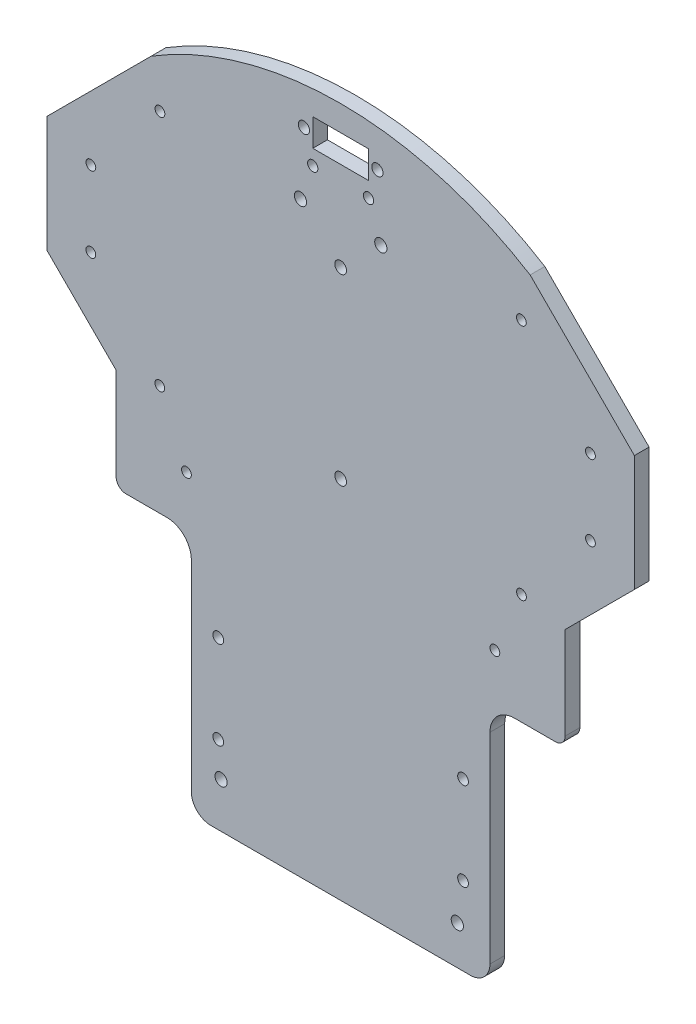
ISO-10303-21;
HEADER;
FILE_DESCRIPTION(('STEP AP214'),'2;1');
FILE_NAME('part.step','',(''),(''),'','','');
FILE_SCHEMA(('AUTOMOTIVE_DESIGN { 1 0 10303 214 1 1 1 1 }'));
ENDSEC;
DATA;
#1=APPLICATION_CONTEXT('core data for automotive mechanical design processes');
#2=APPLICATION_PROTOCOL_DEFINITION('international standard','automotive_design',2000,#1);
#3=PRODUCT_CONTEXT('',#1,'mechanical');
#4=PRODUCT('Part','Part','',(#3));
#5=PRODUCT_RELATED_PRODUCT_CATEGORY('part','',(#4));
#6=PRODUCT_DEFINITION_FORMATION('','',#4);
#7=PRODUCT_DEFINITION_CONTEXT('part definition',#1,'design');
#8=PRODUCT_DEFINITION('design','',#6,#7);
#9=PRODUCT_DEFINITION_SHAPE('','',#8);
#10=(LENGTH_UNIT() NAMED_UNIT(*) SI_UNIT(.MILLI.,.METRE.));
#11=(NAMED_UNIT(*) PLANE_ANGLE_UNIT() SI_UNIT($,.RADIAN.));
#12=(NAMED_UNIT(*) SI_UNIT($,.STERADIAN.) SOLID_ANGLE_UNIT());
#13=UNCERTAINTY_MEASURE_WITH_UNIT(LENGTH_MEASURE(1.E-05),#10,'distance_accuracy_value','');
#14=(GEOMETRIC_REPRESENTATION_CONTEXT(3) GLOBAL_UNCERTAINTY_ASSIGNED_CONTEXT((#13)) GLOBAL_UNIT_ASSIGNED_CONTEXT((#10,
#11,#12)) REPRESENTATION_CONTEXT('',''));
#15=CARTESIAN_POINT('',(0.,0.,0.));
#16=DIRECTION('',(0.,0.,1.));
#17=DIRECTION('',(1.,0.,0.));
#18=AXIS2_PLACEMENT_3D('',#15,#16,#17);
#19=CARTESIAN_POINT('',(26.5,-16.5920931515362,3.));
#20=DIRECTION('',(0.,0.,-1.));
#21=DIRECTION('',(-1.,0.,0.));
#22=AXIS2_PLACEMENT_3D('',#19,#20,#21);
#23=PLANE('',#22);
#24=CARTESIAN_POINT('',(-5.7,106.507906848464,3.));
#25=DIRECTION('',(0.,0.,1.));
#26=DIRECTION('',(-1.,0.,0.));
#27=AXIS2_PLACEMENT_3D('',#24,#25,#26);
#28=CIRCLE('',#27,1.04999999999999);
#29=CARTESIAN_POINT('',(-6.74999999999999,106.507906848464,3.));
#30=VERTEX_POINT('',#29);
#31=EDGE_CURVE('E906',#30,#30,#28,.T.);
#32=ORIENTED_EDGE('',*,*,#31,.F.);
#33=EDGE_LOOP('',(#32));
#34=FACE_BOUND('',#33,.T.);
#35=CARTESIAN_POINT('',(5.7,106.507906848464,3.));
#36=DIRECTION('',(0.,0.,1.));
#37=DIRECTION('',(1.,0.,0.));
#38=AXIS2_PLACEMENT_3D('',#35,#36,#37);
#39=CIRCLE('',#38,1.04999999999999);
#40=CARTESIAN_POINT('',(6.74999999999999,106.507906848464,3.));
#41=VERTEX_POINT('',#40);
#42=EDGE_CURVE('E908',#41,#41,#39,.T.);
#43=ORIENTED_EDGE('',*,*,#42,.F.);
#44=EDGE_LOOP('',(#43));
#45=FACE_BOUND('',#44,.T.);
#46=CARTESIAN_POINT('',(-7.5,112.407906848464,3.));
#47=DIRECTION('',(0.,0.,1.));
#48=DIRECTION('',(-1.,0.,0.));
#49=AXIS2_PLACEMENT_3D('',#46,#47,#48);
#50=CIRCLE('',#49,1.15);
#51=CARTESIAN_POINT('',(-8.65,112.407906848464,3.));
#52=VERTEX_POINT('',#51);
#53=EDGE_CURVE('E916',#52,#52,#50,.T.);
#54=ORIENTED_EDGE('',*,*,#53,.F.);
#55=EDGE_LOOP('',(#54));
#56=FACE_BOUND('',#55,.T.);
#57=CARTESIAN_POINT('',(7.5,112.407906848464,3.));
#58=DIRECTION('',(0.,0.,1.));
#59=DIRECTION('',(1.,0.,0.));
#60=AXIS2_PLACEMENT_3D('',#57,#58,#59);
#61=CIRCLE('',#60,1.15);
#62=CARTESIAN_POINT('',(8.65,112.407906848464,3.));
#63=VERTEX_POINT('',#62);
#64=EDGE_CURVE('E922',#63,#63,#61,.T.);
#65=ORIENTED_EDGE('',*,*,#64,.F.);
#66=EDGE_LOOP('',(#65));
#67=FACE_BOUND('',#66,.T.);
#68=DIRECTION('',(1.,0.,0.));
#69=VECTOR('',#68,1.);
#70=CARTESIAN_POINT('',(-5.7,109.607906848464,3.));
#71=LINE('',#70,#69);
#72=CARTESIAN_POINT('',(-5.7,109.607906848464,3.));
#73=VERTEX_POINT('',#72);
#74=CARTESIAN_POINT('',(5.7,109.607906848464,3.));
#75=VERTEX_POINT('',#74);
#76=EDGE_CURVE('E198',#73,#75,#71,.T.);
#77=ORIENTED_EDGE('',*,*,#76,.F.);
#78=DIRECTION('',(0.,-1.,0.));
#79=VECTOR('',#78,1.);
#80=CARTESIAN_POINT('',(-5.7,115.207906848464,3.));
#81=LINE('',#80,#79);
#82=CARTESIAN_POINT('',(-5.7,115.207906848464,3.));
#83=VERTEX_POINT('',#82);
#84=EDGE_CURVE('E41',#83,#73,#81,.T.);
#85=ORIENTED_EDGE('',*,*,#84,.F.);
#86=DIRECTION('',(-1.,0.,0.));
#87=VECTOR('',#86,1.);
#88=CARTESIAN_POINT('',(-5.7,115.207906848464,3.));
#89=LINE('',#88,#87);
#90=CARTESIAN_POINT('',(5.7,115.207906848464,3.));
#91=VERTEX_POINT('',#90);
#92=EDGE_CURVE('E204',#91,#83,#89,.T.);
#93=ORIENTED_EDGE('',*,*,#92,.F.);
#94=DIRECTION('',(0.,1.,0.));
#95=VECTOR('',#94,1.);
#96=CARTESIAN_POINT('',(5.7,115.207906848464,3.));
#97=LINE('',#96,#95);
#98=EDGE_CURVE('E189',#75,#91,#97,.T.);
#99=ORIENTED_EDGE('',*,*,#98,.F.);
#100=EDGE_LOOP('',(#77,#85,#93,#99));
#101=FACE_BOUND('',#100,.T.);
#102=CARTESIAN_POINT('',(36.9139673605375,100.544435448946,3.));
#103=DIRECTION('',(0.,0.,1.));
#104=DIRECTION('',(-1.,0.,0.));
#105=AXIS2_PLACEMENT_3D('',#102,#103,#104);
#106=CIRCLE('',#105,0.999999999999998);
#107=CARTESIAN_POINT('',(35.9139673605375,100.544435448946,3.));
#108=VERTEX_POINT('',#107);
#109=EDGE_CURVE('E220',#108,#108,#106,.T.);
#110=ORIENTED_EDGE('',*,*,#109,.F.);
#111=EDGE_LOOP('',(#110));
#112=FACE_BOUND('',#111,.T.);
#113=CARTESIAN_POINT('',(51.022719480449,83.9890273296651,3.));
#114=DIRECTION('',(0.,0.,1.));
#115=DIRECTION('',(-1.,0.,0.));
#116=AXIS2_PLACEMENT_3D('',#113,#114,#115);
#117=CIRCLE('',#116,0.999999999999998);
#118=CARTESIAN_POINT('',(50.022719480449,83.9890273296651,3.));
#119=VERTEX_POINT('',#118);
#120=EDGE_CURVE('E228',#119,#119,#117,.T.);
#121=ORIENTED_EDGE('',*,*,#120,.F.);
#122=EDGE_LOOP('',(#121));
#123=FACE_BOUND('',#122,.T.);
#124=CARTESIAN_POINT('',(51.022719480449,68.5643506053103,3.));
#125=DIRECTION('',(0.,0.,1.));
#126=DIRECTION('',(-1.,0.,0.));
#127=AXIS2_PLACEMENT_3D('',#124,#125,#126);
#128=CIRCLE('',#127,0.999999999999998);
#129=CARTESIAN_POINT('',(50.022719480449,68.5643506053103,3.));
#130=VERTEX_POINT('',#129);
#131=EDGE_CURVE('E234',#130,#130,#128,.T.);
#132=ORIENTED_EDGE('',*,*,#131,.F.);
#133=EDGE_LOOP('',(#132));
#134=FACE_BOUND('',#133,.T.);
#135=CARTESIAN_POINT('',(36.9377821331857,51.9951930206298,3.));
#136=DIRECTION('',(0.,0.,1.));
#137=DIRECTION('',(-1.,0.,0.));
#138=AXIS2_PLACEMENT_3D('',#135,#136,#137);
#139=CIRCLE('',#138,0.999999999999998);
#140=CARTESIAN_POINT('',(35.9377821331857,51.9951930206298,3.));
#141=VERTEX_POINT('',#140);
#142=EDGE_CURVE('E240',#141,#141,#139,.T.);
#143=ORIENTED_EDGE('',*,*,#142,.F.);
#144=EDGE_LOOP('',(#143));
#145=FACE_BOUND('',#144,.T.);
#146=CARTESIAN_POINT('',(-36.9377821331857,51.9951930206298,3.));
#147=DIRECTION('',(0.,0.,1.));
#148=DIRECTION('',(1.,0.,0.));
#149=AXIS2_PLACEMENT_3D('',#146,#147,#148);
#150=CIRCLE('',#149,0.999999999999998);
#151=CARTESIAN_POINT('',(-35.9377821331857,51.9951930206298,3.));
#152=VERTEX_POINT('',#151);
#153=EDGE_CURVE('E246',#152,#152,#150,.T.);
#154=ORIENTED_EDGE('',*,*,#153,.F.);
#155=EDGE_LOOP('',(#154));
#156=FACE_BOUND('',#155,.T.);
#157=CARTESIAN_POINT('',(-51.022719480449,68.5643506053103,3.));
#158=DIRECTION('',(0.,0.,1.));
#159=DIRECTION('',(1.,0.,0.));
#160=AXIS2_PLACEMENT_3D('',#157,#158,#159);
#161=CIRCLE('',#160,0.999999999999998);
#162=CARTESIAN_POINT('',(-50.022719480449,68.5643506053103,3.));
#163=VERTEX_POINT('',#162);
#164=EDGE_CURVE('E252',#163,#163,#161,.T.);
#165=ORIENTED_EDGE('',*,*,#164,.F.);
#166=EDGE_LOOP('',(#165));
#167=FACE_BOUND('',#166,.T.);
#168=CARTESIAN_POINT('',(-51.022719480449,83.9890273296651,3.));
#169=DIRECTION('',(0.,0.,1.));
#170=DIRECTION('',(1.,0.,0.));
#171=AXIS2_PLACEMENT_3D('',#168,#169,#170);
#172=CIRCLE('',#171,0.999999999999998);
#173=CARTESIAN_POINT('',(-50.022719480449,83.9890273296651,3.));
#174=VERTEX_POINT('',#173);
#175=EDGE_CURVE('E258',#174,#174,#172,.T.);
#176=ORIENTED_EDGE('',*,*,#175,.F.);
#177=EDGE_LOOP('',(#176));
#178=FACE_BOUND('',#177,.T.);
#179=CARTESIAN_POINT('',(-36.9139673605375,100.544435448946,3.));
#180=DIRECTION('',(0.,0.,1.));
#181=DIRECTION('',(1.,0.,0.));
#182=AXIS2_PLACEMENT_3D('',#179,#180,#181);
#183=CIRCLE('',#182,0.999999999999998);
#184=CARTESIAN_POINT('',(-35.9139673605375,100.544435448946,3.));
#185=VERTEX_POINT('',#184);
#186=EDGE_CURVE('E264',#185,#185,#183,.T.);
#187=ORIENTED_EDGE('',*,*,#186,.F.);
#188=EDGE_LOOP('',(#187));
#189=FACE_BOUND('',#188,.T.);
#190=CARTESIAN_POINT('',(-24.43,-11.3920931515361,3.));
#191=DIRECTION('',(0.,0.,1.));
#192=DIRECTION('',(1.,0.,0.));
#193=AXIS2_PLACEMENT_3D('',#190,#191,#192);
#194=CIRCLE('',#193,1.25);
#195=CARTESIAN_POINT('',(-23.18,-11.3920931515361,3.));
#196=VERTEX_POINT('',#195);
#197=EDGE_CURVE('E284',#196,#196,#194,.T.);
#198=ORIENTED_EDGE('',*,*,#197,.F.);
#199=EDGE_LOOP('',(#198));
#200=FACE_BOUND('',#199,.T.);
#201=CARTESIAN_POINT('',(-31.5,39.4079068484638,3.));
#202=DIRECTION('',(0.,0.,1.));
#203=DIRECTION('',(1.,0.,0.));
#204=AXIS2_PLACEMENT_3D('',#201,#202,#203);
#205=CIRCLE('',#204,1.00000000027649);
#206=CARTESIAN_POINT('',(-30.4999999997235,39.4079068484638,3.));
#207=VERTEX_POINT('',#206);
#208=EDGE_CURVE('E296',#207,#207,#205,.T.);
#209=ORIENTED_EDGE('',*,*,#208,.F.);
#210=EDGE_LOOP('',(#209));
#211=FACE_BOUND('',#210,.T.);
#212=CARTESIAN_POINT('',(-25.,-4.59209315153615,3.));
#213=DIRECTION('',(0.,0.,1.));
#214=DIRECTION('',(-1.,0.,0.));
#215=AXIS2_PLACEMENT_3D('',#212,#213,#214);
#216=CIRCLE('',#215,1.1);
#217=CARTESIAN_POINT('',(-26.1,-4.59209315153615,3.));
#218=VERTEX_POINT('',#217);
#219=EDGE_CURVE('E308',#218,#218,#216,.T.);
#220=ORIENTED_EDGE('',*,*,#219,.F.);
#221=EDGE_LOOP('',(#220));
#222=FACE_BOUND('',#221,.T.);
#223=CARTESIAN_POINT('',(25.,-4.59209315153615,3.));
#224=DIRECTION('',(0.,0.,1.));
#225=DIRECTION('',(1.,0.,0.));
#226=AXIS2_PLACEMENT_3D('',#223,#224,#225);
#227=CIRCLE('',#226,1.1);
#228=CARTESIAN_POINT('',(26.1,-4.59209315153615,3.));
#229=VERTEX_POINT('',#228);
#230=EDGE_CURVE('E320',#229,#229,#227,.T.);
#231=ORIENTED_EDGE('',*,*,#230,.F.);
#232=EDGE_LOOP('',(#231));
#233=FACE_BOUND('',#232,.T.);
#234=CARTESIAN_POINT('',(8.2,99.4079068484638,3.));
#235=DIRECTION('',(0.,0.,1.));
#236=DIRECTION('',(1.,0.,0.));
#237=AXIS2_PLACEMENT_3D('',#234,#235,#236);
#238=CIRCLE('',#237,1.25);
#239=CARTESIAN_POINT('',(9.45,99.4079068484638,3.));
#240=VERTEX_POINT('',#239);
#241=EDGE_CURVE('E332',#240,#240,#238,.T.);
#242=ORIENTED_EDGE('',*,*,#241,.F.);
#243=EDGE_LOOP('',(#242));
#244=FACE_BOUND('',#243,.T.);
#245=CARTESIAN_POINT('',(0.,91.4079068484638,3.));
#246=DIRECTION('',(0.,0.,1.));
#247=DIRECTION('',(1.,0.,0.));
#248=AXIS2_PLACEMENT_3D('',#245,#246,#247);
#249=CIRCLE('',#248,1.20000000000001);
#250=CARTESIAN_POINT('',(1.20000000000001,91.4079068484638,3.));
#251=VERTEX_POINT('',#250);
#252=EDGE_CURVE('E344',#251,#251,#249,.T.);
#253=ORIENTED_EDGE('',*,*,#252,.F.);
#254=EDGE_LOOP('',(#253));
#255=FACE_BOUND('',#254,.T.);
#256=CARTESIAN_POINT('',(26.5,-16.5920931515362,3.));
#257=DIRECTION('',(0.,0.,1.));
#258=DIRECTION('',(-1.,0.,0.));
#259=AXIS2_PLACEMENT_3D('',#256,#257,#258);
#260=CIRCLE('',#259,4.);
#261=CARTESIAN_POINT('',(26.5,-20.5920931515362,3.));
#262=VERTEX_POINT('',#261);
#263=CARTESIAN_POINT('',(30.5,-16.5920931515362,3.));
#264=VERTEX_POINT('',#263);
#265=EDGE_CURVE('E387',#262,#264,#260,.T.);
#266=ORIENTED_EDGE('',*,*,#265,.T.);
#267=DIRECTION('',(0.,1.,0.));
#268=VECTOR('',#267,1.);
#269=CARTESIAN_POINT('',(30.5,-16.5920931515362,3.));
#270=LINE('',#269,#268);
#271=CARTESIAN_POINT('',(30.5,24.4079068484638,3.));
#272=VERTEX_POINT('',#271);
#273=EDGE_CURVE('E390',#264,#272,#270,.T.);
#274=ORIENTED_EDGE('',*,*,#273,.T.);
#275=CARTESIAN_POINT('',(35.5,24.4079068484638,3.));
#276=DIRECTION('',(0.,0.,-1.));
#277=DIRECTION('',(1.,0.,0.));
#278=AXIS2_PLACEMENT_3D('',#275,#276,#277);
#279=CIRCLE('',#278,5.);
#280=CARTESIAN_POINT('',(35.4999999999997,29.4079068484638,3.));
#281=VERTEX_POINT('',#280);
#282=EDGE_CURVE('E392',#272,#281,#279,.T.);
#283=ORIENTED_EDGE('',*,*,#282,.T.);
#284=DIRECTION('',(1.,0.,0.));
#285=VECTOR('',#284,1.);
#286=CARTESIAN_POINT('',(35.4999999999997,29.4079068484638,3.));
#287=LINE('',#286,#285);
#288=CARTESIAN_POINT('',(43.857864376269,29.4079068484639,3.));
#289=VERTEX_POINT('',#288);
#290=EDGE_CURVE('E394',#281,#289,#287,.T.);
#291=ORIENTED_EDGE('',*,*,#290,.T.);
#292=CARTESIAN_POINT('',(43.857864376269,31.4079068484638,3.));
#293=DIRECTION('',(0.,0.,1.));
#294=DIRECTION('',(1.,0.,0.));
#295=AXIS2_PLACEMENT_3D('',#292,#293,#294);
#296=CIRCLE('',#295,1.99999999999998);
#297=CARTESIAN_POINT('',(45.857864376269,31.4079068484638,3.));
#298=VERTEX_POINT('',#297);
#299=EDGE_CURVE('E396',#289,#298,#296,.T.);
#300=ORIENTED_EDGE('',*,*,#299,.T.);
#301=DIRECTION('',(0.,1.,0.));
#302=VECTOR('',#301,1.);
#303=CARTESIAN_POINT('',(45.857864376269,31.4079068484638,3.));
#304=LINE('',#303,#302);
#305=CARTESIAN_POINT('',(45.857864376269,50.2657712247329,3.));
#306=VERTEX_POINT('',#305);
#307=EDGE_CURVE('E398',#298,#306,#304,.T.);
#308=ORIENTED_EDGE('',*,*,#307,.T.);
#309=DIRECTION('',(0.70710678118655,0.707106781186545,0.));
#310=VECTOR('',#309,1.);
#311=CARTESIAN_POINT('',(45.857864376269,50.2657712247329,3.));
#312=LINE('',#311,#310);
#313=CARTESIAN_POINT('',(60.,64.4079068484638,3.));
#314=VERTEX_POINT('',#313);
#315=EDGE_CURVE('E400',#306,#314,#312,.T.);
#316=ORIENTED_EDGE('',*,*,#315,.T.);
#317=DIRECTION('',(0.,1.,0.));
#318=VECTOR('',#317,1.);
#319=CARTESIAN_POINT('',(60.,64.4079068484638,3.));
#320=LINE('',#319,#318);
#321=CARTESIAN_POINT('',(60.,88.1079068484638,3.));
#322=VERTEX_POINT('',#321);
#323=EDGE_CURVE('E402',#314,#322,#320,.T.);
#324=ORIENTED_EDGE('',*,*,#323,.T.);
#325=DIRECTION('',(-0.707106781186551,0.707106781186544,0.));
#326=VECTOR('',#325,1.);
#327=CARTESIAN_POINT('',(38.6999999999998,109.407906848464,3.));
#328=LINE('',#327,#326);
#329=CARTESIAN_POINT('',(38.6999999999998,109.407906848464,3.));
#330=VERTEX_POINT('',#329);
#331=EDGE_CURVE('E404',#322,#330,#328,.T.);
#332=ORIENTED_EDGE('',*,*,#331,.T.);
#333=CARTESIAN_POINT('',(0.,46.6744855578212,3.));
#334=DIRECTION('',(0.,0.,1.));
#335=DIRECTION('',(-1.,0.,0.));
#336=AXIS2_PLACEMENT_3D('',#333,#334,#335);
#337=CIRCLE('',#336,73.7100545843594);
#338=CARTESIAN_POINT('',(-38.6999999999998,109.407906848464,3.));
#339=VERTEX_POINT('',#338);
#340=EDGE_CURVE('E270',#330,#339,#337,.T.);
#341=ORIENTED_EDGE('',*,*,#340,.T.);
#342=DIRECTION('',(-0.707106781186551,-0.707106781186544,0.));
#343=VECTOR('',#342,1.);
#344=CARTESIAN_POINT('',(-38.6999999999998,109.407906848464,3.));
#345=LINE('',#344,#343);
#346=CARTESIAN_POINT('',(-60.,88.1079068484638,3.));
#347=VERTEX_POINT('',#346);
#348=EDGE_CURVE('E407',#339,#347,#345,.T.);
#349=ORIENTED_EDGE('',*,*,#348,.T.);
#350=DIRECTION('',(0.,-1.,0.));
#351=VECTOR('',#350,1.);
#352=CARTESIAN_POINT('',(-60.,64.4079068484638,3.));
#353=LINE('',#352,#351);
#354=CARTESIAN_POINT('',(-60.,64.4079068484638,3.));
#355=VERTEX_POINT('',#354);
#356=EDGE_CURVE('E409',#347,#355,#353,.T.);
#357=ORIENTED_EDGE('',*,*,#356,.T.);
#358=DIRECTION('',(0.70710678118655,-0.707106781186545,0.));
#359=VECTOR('',#358,1.);
#360=CARTESIAN_POINT('',(-45.857864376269,50.2657712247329,3.));
#361=LINE('',#360,#359);
#362=CARTESIAN_POINT('',(-45.857864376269,50.2657712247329,3.));
#363=VERTEX_POINT('',#362);
#364=EDGE_CURVE('E411',#355,#363,#361,.T.);
#365=ORIENTED_EDGE('',*,*,#364,.T.);
#366=DIRECTION('',(0.,-1.,0.));
#367=VECTOR('',#366,1.);
#368=CARTESIAN_POINT('',(-45.857864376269,31.4079068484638,3.));
#369=LINE('',#368,#367);
#370=CARTESIAN_POINT('',(-45.857864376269,31.4079068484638,3.));
#371=VERTEX_POINT('',#370);
#372=EDGE_CURVE('E413',#363,#371,#369,.T.);
#373=ORIENTED_EDGE('',*,*,#372,.T.);
#374=CARTESIAN_POINT('',(-43.857864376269,31.4079068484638,3.));
#375=DIRECTION('',(0.,0.,1.));
#376=DIRECTION('',(-1.,0.,0.));
#377=AXIS2_PLACEMENT_3D('',#374,#375,#376);
#378=CIRCLE('',#377,1.99999999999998);
#379=CARTESIAN_POINT('',(-43.857864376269,29.4079068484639,3.));
#380=VERTEX_POINT('',#379);
#381=EDGE_CURVE('E415',#371,#380,#378,.T.);
#382=ORIENTED_EDGE('',*,*,#381,.T.);
#383=DIRECTION('',(1.,0.,0.));
#384=VECTOR('',#383,1.);
#385=CARTESIAN_POINT('',(-35.4999999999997,29.4079068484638,3.));
#386=LINE('',#385,#384);
#387=CARTESIAN_POINT('',(-35.4999999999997,29.4079068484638,3.));
#388=VERTEX_POINT('',#387);
#389=EDGE_CURVE('E417',#380,#388,#386,.T.);
#390=ORIENTED_EDGE('',*,*,#389,.T.);
#391=CARTESIAN_POINT('',(-35.5,24.4079068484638,3.));
#392=DIRECTION('',(0.,0.,-1.));
#393=DIRECTION('',(-1.,0.,0.));
#394=AXIS2_PLACEMENT_3D('',#391,#392,#393);
#395=CIRCLE('',#394,5.);
#396=CARTESIAN_POINT('',(-30.5,24.4079068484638,3.));
#397=VERTEX_POINT('',#396);
#398=EDGE_CURVE('E419',#388,#397,#395,.T.);
#399=ORIENTED_EDGE('',*,*,#398,.T.);
#400=DIRECTION('',(0.,-1.,0.));
#401=VECTOR('',#400,1.);
#402=CARTESIAN_POINT('',(-30.5,-16.5920931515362,3.));
#403=LINE('',#402,#401);
#404=CARTESIAN_POINT('',(-30.5,-16.5920931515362,3.));
#405=VERTEX_POINT('',#404);
#406=EDGE_CURVE('E421',#397,#405,#403,.T.);
#407=ORIENTED_EDGE('',*,*,#406,.T.);
#408=CARTESIAN_POINT('',(-26.5,-16.5920931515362,3.));
#409=DIRECTION('',(0.,0.,1.));
#410=DIRECTION('',(1.,0.,0.));
#411=AXIS2_PLACEMENT_3D('',#408,#409,#410);
#412=CIRCLE('',#411,4.);
#413=CARTESIAN_POINT('',(-26.5,-20.5920931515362,3.));
#414=VERTEX_POINT('',#413);
#415=EDGE_CURVE('E423',#405,#414,#412,.T.);
#416=ORIENTED_EDGE('',*,*,#415,.T.);
#417=DIRECTION('',(1.,0.,0.));
#418=VECTOR('',#417,1.);
#419=CARTESIAN_POINT('',(-26.5,-20.5920931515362,3.));
#420=LINE('',#419,#418);
#421=EDGE_CURVE('E425',#414,#262,#420,.T.);
#422=ORIENTED_EDGE('',*,*,#421,.T.);
#423=EDGE_LOOP('',(#266,#274,#283,#291,#300,#308,#316,#324,#332,#341,#349,#357,#365,#373,#382,
#390,#399,#407,#416,#422));
#424=FACE_BOUND('',#423,.T.);
#425=CARTESIAN_POINT('',(0.,54.0079068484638,3.));
#426=DIRECTION('',(0.,0.,1.));
#427=DIRECTION('',(1.,0.,0.));
#428=AXIS2_PLACEMENT_3D('',#425,#426,#427);
#429=CIRCLE('',#428,1.2);
#430=CARTESIAN_POINT('',(1.2,54.0079068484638,3.));
#431=VERTEX_POINT('',#430);
#432=EDGE_CURVE('E338',#431,#431,#429,.T.);
#433=ORIENTED_EDGE('',*,*,#432,.F.);
#434=EDGE_LOOP('',(#433));
#435=FACE_BOUND('',#434,.T.);
#436=CARTESIAN_POINT('',(-8.2,99.4079068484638,3.));
#437=DIRECTION('',(0.,0.,1.));
#438=DIRECTION('',(-1.,0.,0.));
#439=AXIS2_PLACEMENT_3D('',#436,#437,#438);
#440=CIRCLE('',#439,1.25);
#441=CARTESIAN_POINT('',(-9.45,99.4079068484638,3.));
#442=VERTEX_POINT('',#441);
#443=EDGE_CURVE('E326',#442,#442,#440,.T.);
#444=ORIENTED_EDGE('',*,*,#443,.F.);
#445=EDGE_LOOP('',(#444));
#446=FACE_BOUND('',#445,.T.);
#447=CARTESIAN_POINT('',(25.,13.4079068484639,3.));
#448=DIRECTION('',(0.,0.,1.));
#449=DIRECTION('',(-1.,0.,0.));
#450=AXIS2_PLACEMENT_3D('',#447,#448,#449);
#451=CIRCLE('',#450,1.1);
#452=CARTESIAN_POINT('',(23.9,13.4079068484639,3.));
#453=VERTEX_POINT('',#452);
#454=EDGE_CURVE('E314',#453,#453,#451,.T.);
#455=ORIENTED_EDGE('',*,*,#454,.F.);
#456=EDGE_LOOP('',(#455));
#457=FACE_BOUND('',#456,.T.);
#458=CARTESIAN_POINT('',(-25.,13.4079068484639,3.));
#459=DIRECTION('',(0.,0.,1.));
#460=DIRECTION('',(1.,0.,0.));
#461=AXIS2_PLACEMENT_3D('',#458,#459,#460);
#462=CIRCLE('',#461,1.1);
#463=CARTESIAN_POINT('',(-23.9,13.4079068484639,3.));
#464=VERTEX_POINT('',#463);
#465=EDGE_CURVE('E302',#464,#464,#462,.T.);
#466=ORIENTED_EDGE('',*,*,#465,.F.);
#467=EDGE_LOOP('',(#466));
#468=FACE_BOUND('',#467,.T.);
#469=CARTESIAN_POINT('',(31.5,39.4079068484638,3.));
#470=DIRECTION('',(0.,0.,1.));
#471=DIRECTION('',(-1.,0.,0.));
#472=AXIS2_PLACEMENT_3D('',#469,#470,#471);
#473=CIRCLE('',#472,1.00000000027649);
#474=CARTESIAN_POINT('',(30.4999999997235,39.4079068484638,3.));
#475=VERTEX_POINT('',#474);
#476=EDGE_CURVE('E290',#475,#475,#473,.T.);
#477=ORIENTED_EDGE('',*,*,#476,.F.);
#478=EDGE_LOOP('',(#477));
#479=FACE_BOUND('',#478,.T.);
#480=CARTESIAN_POINT('',(23.83,-12.6620931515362,3.));
#481=DIRECTION('',(0.,0.,1.));
#482=DIRECTION('',(1.,0.,0.));
#483=AXIS2_PLACEMENT_3D('',#480,#481,#482);
#484=CIRCLE('',#483,1.25);
#485=CARTESIAN_POINT('',(25.08,-12.6620931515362,3.));
#486=VERTEX_POINT('',#485);
#487=EDGE_CURVE('E278',#486,#486,#484,.T.);
#488=ORIENTED_EDGE('',*,*,#487,.F.);
#489=EDGE_LOOP('',(#488));
#490=FACE_BOUND('',#489,.T.);
#491=ADVANCED_FACE('F26',(#34,#45,#56,#67,#101,#112,#123,#134,#145,#156,#167,#178,#189,#200,
#211,#222,#233,#244,#255,#424,#435,#446,#457,#468,#479,#490),#23,.F.);
#492=CARTESIAN_POINT('',(26.5,-16.5920931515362,0.));
#493=DIRECTION('',(0.,0.,-1.));
#494=DIRECTION('',(-1.,0.,0.));
#495=AXIS2_PLACEMENT_3D('',#492,#493,#494);
#496=PLANE('',#495);
#497=CARTESIAN_POINT('',(-5.7,106.507906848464,0.));
#498=DIRECTION('',(0.,0.,1.));
#499=DIRECTION('',(-1.,0.,0.));
#500=AXIS2_PLACEMENT_3D('',#497,#498,#499);
#501=CIRCLE('',#500,1.04999999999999);
#502=CARTESIAN_POINT('',(-6.74999999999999,106.507906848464,0.));
#503=VERTEX_POINT('',#502);
#504=EDGE_CURVE('E904',#503,#503,#501,.T.);
#505=ORIENTED_EDGE('',*,*,#504,.T.);
#506=EDGE_LOOP('',(#505));
#507=FACE_BOUND('',#506,.T.);
#508=CARTESIAN_POINT('',(5.7,106.507906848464,0.));
#509=DIRECTION('',(0.,0.,1.));
#510=DIRECTION('',(1.,0.,0.));
#511=AXIS2_PLACEMENT_3D('',#508,#509,#510);
#512=CIRCLE('',#511,1.04999999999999);
#513=CARTESIAN_POINT('',(6.74999999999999,106.507906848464,0.));
#514=VERTEX_POINT('',#513);
#515=EDGE_CURVE('E913',#514,#514,#512,.T.);
#516=ORIENTED_EDGE('',*,*,#515,.T.);
#517=EDGE_LOOP('',(#516));
#518=FACE_BOUND('',#517,.T.);
#519=CARTESIAN_POINT('',(-7.5,112.407906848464,0.));
#520=DIRECTION('',(0.,0.,1.));
#521=DIRECTION('',(-1.,0.,0.));
#522=AXIS2_PLACEMENT_3D('',#519,#520,#521);
#523=CIRCLE('',#522,1.15);
#524=CARTESIAN_POINT('',(-8.65,112.407906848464,0.));
#525=VERTEX_POINT('',#524);
#526=EDGE_CURVE('E919',#525,#525,#523,.T.);
#527=ORIENTED_EDGE('',*,*,#526,.T.);
#528=EDGE_LOOP('',(#527));
#529=FACE_BOUND('',#528,.T.);
#530=CARTESIAN_POINT('',(7.5,112.407906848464,0.));
#531=DIRECTION('',(0.,0.,1.));
#532=DIRECTION('',(1.,0.,0.));
#533=AXIS2_PLACEMENT_3D('',#530,#531,#532);
#534=CIRCLE('',#533,1.15);
#535=CARTESIAN_POINT('',(8.65,112.407906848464,0.));
#536=VERTEX_POINT('',#535);
#537=EDGE_CURVE('E925',#536,#536,#534,.T.);
#538=ORIENTED_EDGE('',*,*,#537,.T.);
#539=EDGE_LOOP('',(#538));
#540=FACE_BOUND('',#539,.T.);
#541=DIRECTION('',(0.,-1.,0.));
#542=VECTOR('',#541,1.);
#543=CARTESIAN_POINT('',(-5.7,115.207906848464,0.));
#544=LINE('',#543,#542);
#545=CARTESIAN_POINT('',(-5.7,115.207906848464,0.));
#546=VERTEX_POINT('',#545);
#547=CARTESIAN_POINT('',(-5.7,109.607906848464,0.));
#548=VERTEX_POINT('',#547);
#549=EDGE_CURVE('E206',#546,#548,#544,.T.);
#550=ORIENTED_EDGE('',*,*,#549,.T.);
#551=DIRECTION('',(1.,0.,0.));
#552=VECTOR('',#551,1.);
#553=CARTESIAN_POINT('',(-5.7,109.607906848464,0.));
#554=LINE('',#553,#552);
#555=CARTESIAN_POINT('',(5.7,109.607906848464,0.));
#556=VERTEX_POINT('',#555);
#557=EDGE_CURVE('E212',#548,#556,#554,.T.);
#558=ORIENTED_EDGE('',*,*,#557,.T.);
#559=DIRECTION('',(0.,1.,0.));
#560=VECTOR('',#559,1.);
#561=CARTESIAN_POINT('',(5.7,115.207906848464,0.));
#562=LINE('',#561,#560);
#563=CARTESIAN_POINT('',(5.7,115.207906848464,0.));
#564=VERTEX_POINT('',#563);
#565=EDGE_CURVE('E49',#556,#564,#562,.T.);
#566=ORIENTED_EDGE('',*,*,#565,.T.);
#567=DIRECTION('',(-1.,0.,0.));
#568=VECTOR('',#567,1.);
#569=CARTESIAN_POINT('',(-5.7,115.207906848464,0.));
#570=LINE('',#569,#568);
#571=EDGE_CURVE('E215',#564,#546,#570,.T.);
#572=ORIENTED_EDGE('',*,*,#571,.T.);
#573=EDGE_LOOP('',(#550,#558,#566,#572));
#574=FACE_BOUND('',#573,.T.);
#575=CARTESIAN_POINT('',(36.9139673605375,100.544435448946,0.));
#576=DIRECTION('',(0.,0.,1.));
#577=DIRECTION('',(-1.,0.,0.));
#578=AXIS2_PLACEMENT_3D('',#575,#576,#577);
#579=CIRCLE('',#578,0.999999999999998);
#580=CARTESIAN_POINT('',(35.9139673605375,100.544435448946,0.));
#581=VERTEX_POINT('',#580);
#582=EDGE_CURVE('E225',#581,#581,#579,.T.);
#583=ORIENTED_EDGE('',*,*,#582,.T.);
#584=EDGE_LOOP('',(#583));
#585=FACE_BOUND('',#584,.T.);
#586=CARTESIAN_POINT('',(51.022719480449,83.9890273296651,0.));
#587=DIRECTION('',(0.,0.,1.));
#588=DIRECTION('',(-1.,0.,0.));
#589=AXIS2_PLACEMENT_3D('',#586,#587,#588);
#590=CIRCLE('',#589,0.999999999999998);
#591=CARTESIAN_POINT('',(50.022719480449,83.9890273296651,0.));
#592=VERTEX_POINT('',#591);
#593=EDGE_CURVE('E231',#592,#592,#590,.T.);
#594=ORIENTED_EDGE('',*,*,#593,.T.);
#595=EDGE_LOOP('',(#594));
#596=FACE_BOUND('',#595,.T.);
#597=CARTESIAN_POINT('',(51.022719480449,68.5643506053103,0.));
#598=DIRECTION('',(0.,0.,1.));
#599=DIRECTION('',(-1.,0.,0.));
#600=AXIS2_PLACEMENT_3D('',#597,#598,#599);
#601=CIRCLE('',#600,0.999999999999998);
#602=CARTESIAN_POINT('',(50.022719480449,68.5643506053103,0.));
#603=VERTEX_POINT('',#602);
#604=EDGE_CURVE('E237',#603,#603,#601,.T.);
#605=ORIENTED_EDGE('',*,*,#604,.T.);
#606=EDGE_LOOP('',(#605));
#607=FACE_BOUND('',#606,.T.);
#608=CARTESIAN_POINT('',(36.9377821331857,51.9951930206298,0.));
#609=DIRECTION('',(0.,0.,1.));
#610=DIRECTION('',(-1.,0.,0.));
#611=AXIS2_PLACEMENT_3D('',#608,#609,#610);
#612=CIRCLE('',#611,0.999999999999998);
#613=CARTESIAN_POINT('',(35.9377821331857,51.9951930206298,0.));
#614=VERTEX_POINT('',#613);
#615=EDGE_CURVE('E243',#614,#614,#612,.T.);
#616=ORIENTED_EDGE('',*,*,#615,.T.);
#617=EDGE_LOOP('',(#616));
#618=FACE_BOUND('',#617,.T.);
#619=CARTESIAN_POINT('',(-36.9377821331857,51.9951930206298,0.));
#620=DIRECTION('',(0.,0.,1.));
#621=DIRECTION('',(1.,0.,0.));
#622=AXIS2_PLACEMENT_3D('',#619,#620,#621);
#623=CIRCLE('',#622,0.999999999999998);
#624=CARTESIAN_POINT('',(-35.9377821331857,51.9951930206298,0.));
#625=VERTEX_POINT('',#624);
#626=EDGE_CURVE('E249',#625,#625,#623,.T.);
#627=ORIENTED_EDGE('',*,*,#626,.T.);
#628=EDGE_LOOP('',(#627));
#629=FACE_BOUND('',#628,.T.);
#630=CARTESIAN_POINT('',(-51.022719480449,68.5643506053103,0.));
#631=DIRECTION('',(0.,0.,1.));
#632=DIRECTION('',(1.,0.,0.));
#633=AXIS2_PLACEMENT_3D('',#630,#631,#632);
#634=CIRCLE('',#633,0.999999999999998);
#635=CARTESIAN_POINT('',(-50.022719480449,68.5643506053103,0.));
#636=VERTEX_POINT('',#635);
#637=EDGE_CURVE('E255',#636,#636,#634,.T.);
#638=ORIENTED_EDGE('',*,*,#637,.T.);
#639=EDGE_LOOP('',(#638));
#640=FACE_BOUND('',#639,.T.);
#641=CARTESIAN_POINT('',(-51.022719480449,83.9890273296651,0.));
#642=DIRECTION('',(0.,0.,1.));
#643=DIRECTION('',(1.,0.,0.));
#644=AXIS2_PLACEMENT_3D('',#641,#642,#643);
#645=CIRCLE('',#644,0.999999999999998);
#646=CARTESIAN_POINT('',(-50.022719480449,83.9890273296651,0.));
#647=VERTEX_POINT('',#646);
#648=EDGE_CURVE('E261',#647,#647,#645,.T.);
#649=ORIENTED_EDGE('',*,*,#648,.T.);
#650=EDGE_LOOP('',(#649));
#651=FACE_BOUND('',#650,.T.);
#652=CARTESIAN_POINT('',(-36.9139673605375,100.544435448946,0.));
#653=DIRECTION('',(0.,0.,1.));
#654=DIRECTION('',(1.,0.,0.));
#655=AXIS2_PLACEMENT_3D('',#652,#653,#654);
#656=CIRCLE('',#655,0.999999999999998);
#657=CARTESIAN_POINT('',(-35.9139673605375,100.544435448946,0.));
#658=VERTEX_POINT('',#657);
#659=EDGE_CURVE('E267',#658,#658,#656,.T.);
#660=ORIENTED_EDGE('',*,*,#659,.T.);
#661=EDGE_LOOP('',(#660));
#662=FACE_BOUND('',#661,.T.);
#663=CARTESIAN_POINT('',(-24.43,-11.3920931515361,0.));
#664=DIRECTION('',(0.,0.,1.));
#665=DIRECTION('',(1.,0.,0.));
#666=AXIS2_PLACEMENT_3D('',#663,#664,#665);
#667=CIRCLE('',#666,1.25);
#668=CARTESIAN_POINT('',(-23.18,-11.3920931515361,0.));
#669=VERTEX_POINT('',#668);
#670=EDGE_CURVE('E281',#669,#669,#667,.T.);
#671=ORIENTED_EDGE('',*,*,#670,.T.);
#672=EDGE_LOOP('',(#671));
#673=FACE_BOUND('',#672,.T.);
#674=CARTESIAN_POINT('',(-31.5,39.4079068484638,0.));
#675=DIRECTION('',(0.,0.,1.));
#676=DIRECTION('',(1.,0.,0.));
#677=AXIS2_PLACEMENT_3D('',#674,#675,#676);
#678=CIRCLE('',#677,1.00000000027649);
#679=CARTESIAN_POINT('',(-30.4999999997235,39.4079068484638,0.));
#680=VERTEX_POINT('',#679);
#681=EDGE_CURVE('E293',#680,#680,#678,.T.);
#682=ORIENTED_EDGE('',*,*,#681,.T.);
#683=EDGE_LOOP('',(#682));
#684=FACE_BOUND('',#683,.T.);
#685=CARTESIAN_POINT('',(-25.,-4.59209315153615,0.));
#686=DIRECTION('',(0.,0.,1.));
#687=DIRECTION('',(-1.,0.,0.));
#688=AXIS2_PLACEMENT_3D('',#685,#686,#687);
#689=CIRCLE('',#688,1.1);
#690=CARTESIAN_POINT('',(-26.1,-4.59209315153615,0.));
#691=VERTEX_POINT('',#690);
#692=EDGE_CURVE('E305',#691,#691,#689,.T.);
#693=ORIENTED_EDGE('',*,*,#692,.T.);
#694=EDGE_LOOP('',(#693));
#695=FACE_BOUND('',#694,.T.);
#696=CARTESIAN_POINT('',(25.,-4.59209315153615,0.));
#697=DIRECTION('',(0.,0.,1.));
#698=DIRECTION('',(1.,0.,0.));
#699=AXIS2_PLACEMENT_3D('',#696,#697,#698);
#700=CIRCLE('',#699,1.1);
#701=CARTESIAN_POINT('',(26.1,-4.59209315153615,0.));
#702=VERTEX_POINT('',#701);
#703=EDGE_CURVE('E317',#702,#702,#700,.T.);
#704=ORIENTED_EDGE('',*,*,#703,.T.);
#705=EDGE_LOOP('',(#704));
#706=FACE_BOUND('',#705,.T.);
#707=CARTESIAN_POINT('',(8.2,99.4079068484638,0.));
#708=DIRECTION('',(0.,0.,1.));
#709=DIRECTION('',(1.,0.,0.));
#710=AXIS2_PLACEMENT_3D('',#707,#708,#709);
#711=CIRCLE('',#710,1.25);
#712=CARTESIAN_POINT('',(9.45,99.4079068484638,0.));
#713=VERTEX_POINT('',#712);
#714=EDGE_CURVE('E329',#713,#713,#711,.T.);
#715=ORIENTED_EDGE('',*,*,#714,.T.);
#716=EDGE_LOOP('',(#715));
#717=FACE_BOUND('',#716,.T.);
#718=CARTESIAN_POINT('',(0.,91.4079068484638,0.));
#719=DIRECTION('',(0.,0.,1.));
#720=DIRECTION('',(1.,0.,0.));
#721=AXIS2_PLACEMENT_3D('',#718,#719,#720);
#722=CIRCLE('',#721,1.20000000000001);
#723=CARTESIAN_POINT('',(1.20000000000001,91.4079068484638,0.));
#724=VERTEX_POINT('',#723);
#725=EDGE_CURVE('E341',#724,#724,#722,.T.);
#726=ORIENTED_EDGE('',*,*,#725,.T.);
#727=EDGE_LOOP('',(#726));
#728=FACE_BOUND('',#727,.T.);
#729=CARTESIAN_POINT('',(26.5,-16.5920931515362,0.));
#730=DIRECTION('',(0.,0.,1.));
#731=DIRECTION('',(-1.,0.,0.));
#732=AXIS2_PLACEMENT_3D('',#729,#730,#731);
#733=CIRCLE('',#732,4.);
#734=CARTESIAN_POINT('',(26.5,-20.5920931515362,0.));
#735=VERTEX_POINT('',#734);
#736=CARTESIAN_POINT('',(30.5,-16.5920931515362,0.));
#737=VERTEX_POINT('',#736);
#738=EDGE_CURVE('E347',#735,#737,#733,.T.);
#739=ORIENTED_EDGE('',*,*,#738,.F.);
#740=DIRECTION('',(1.,0.,0.));
#741=VECTOR('',#740,1.);
#742=CARTESIAN_POINT('',(-26.5,-20.5920931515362,0.));
#743=LINE('',#742,#741);
#744=CARTESIAN_POINT('',(-26.5,-20.5920931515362,0.));
#745=VERTEX_POINT('',#744);
#746=EDGE_CURVE('E385',#745,#735,#743,.T.);
#747=ORIENTED_EDGE('',*,*,#746,.F.);
#748=CARTESIAN_POINT('',(-26.5,-16.5920931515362,0.));
#749=DIRECTION('',(0.,0.,1.));
#750=DIRECTION('',(1.,0.,0.));
#751=AXIS2_PLACEMENT_3D('',#748,#749,#750);
#752=CIRCLE('',#751,4.);
#753=CARTESIAN_POINT('',(-30.5,-16.5920931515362,0.));
#754=VERTEX_POINT('',#753);
#755=EDGE_CURVE('E383',#754,#745,#752,.T.);
#756=ORIENTED_EDGE('',*,*,#755,.F.);
#757=DIRECTION('',(0.,-1.,0.));
#758=VECTOR('',#757,1.);
#759=CARTESIAN_POINT('',(-30.5,-16.5920931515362,0.));
#760=LINE('',#759,#758);
#761=CARTESIAN_POINT('',(-30.5,24.4079068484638,0.));
#762=VERTEX_POINT('',#761);
#763=EDGE_CURVE('E381',#762,#754,#760,.T.);
#764=ORIENTED_EDGE('',*,*,#763,.F.);
#765=CARTESIAN_POINT('',(-35.5,24.4079068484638,0.));
#766=DIRECTION('',(0.,0.,-1.));
#767=DIRECTION('',(-1.,0.,0.));
#768=AXIS2_PLACEMENT_3D('',#765,#766,#767);
#769=CIRCLE('',#768,5.);
#770=CARTESIAN_POINT('',(-35.4999999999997,29.4079068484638,0.));
#771=VERTEX_POINT('',#770);
#772=EDGE_CURVE('E379',#771,#762,#769,.T.);
#773=ORIENTED_EDGE('',*,*,#772,.F.);
#774=DIRECTION('',(1.,0.,0.));
#775=VECTOR('',#774,1.);
#776=CARTESIAN_POINT('',(-35.4999999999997,29.4079068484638,0.));
#777=LINE('',#776,#775);
#778=CARTESIAN_POINT('',(-43.857864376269,29.4079068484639,0.));
#779=VERTEX_POINT('',#778);
#780=EDGE_CURVE('E377',#779,#771,#777,.T.);
#781=ORIENTED_EDGE('',*,*,#780,.F.);
#782=CARTESIAN_POINT('',(-43.857864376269,31.4079068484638,0.));
#783=DIRECTION('',(0.,0.,1.));
#784=DIRECTION('',(-1.,0.,0.));
#785=AXIS2_PLACEMENT_3D('',#782,#783,#784);
#786=CIRCLE('',#785,1.99999999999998);
#787=CARTESIAN_POINT('',(-45.857864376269,31.4079068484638,0.));
#788=VERTEX_POINT('',#787);
#789=EDGE_CURVE('E375',#788,#779,#786,.T.);
#790=ORIENTED_EDGE('',*,*,#789,.F.);
#791=DIRECTION('',(0.,-1.,0.));
#792=VECTOR('',#791,1.);
#793=CARTESIAN_POINT('',(-45.857864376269,31.4079068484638,0.));
#794=LINE('',#793,#792);
#795=CARTESIAN_POINT('',(-45.857864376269,50.2657712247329,0.));
#796=VERTEX_POINT('',#795);
#797=EDGE_CURVE('E373',#796,#788,#794,.T.);
#798=ORIENTED_EDGE('',*,*,#797,.F.);
#799=DIRECTION('',(0.70710678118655,-0.707106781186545,0.));
#800=VECTOR('',#799,1.);
#801=CARTESIAN_POINT('',(-45.857864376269,50.2657712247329,0.));
#802=LINE('',#801,#800);
#803=CARTESIAN_POINT('',(-60.,64.4079068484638,0.));
#804=VERTEX_POINT('',#803);
#805=EDGE_CURVE('E371',#804,#796,#802,.T.);
#806=ORIENTED_EDGE('',*,*,#805,.F.);
#807=DIRECTION('',(0.,-1.,0.));
#808=VECTOR('',#807,1.);
#809=CARTESIAN_POINT('',(-60.,64.4079068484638,0.));
#810=LINE('',#809,#808);
#811=CARTESIAN_POINT('',(-60.,88.1079068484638,0.));
#812=VERTEX_POINT('',#811);
#813=EDGE_CURVE('E369',#812,#804,#810,.T.);
#814=ORIENTED_EDGE('',*,*,#813,.F.);
#815=DIRECTION('',(-0.707106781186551,-0.707106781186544,0.));
#816=VECTOR('',#815,1.);
#817=CARTESIAN_POINT('',(-38.6999999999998,109.407906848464,0.));
#818=LINE('',#817,#816);
#819=CARTESIAN_POINT('',(-38.6999999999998,109.407906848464,0.));
#820=VERTEX_POINT('',#819);
#821=EDGE_CURVE('E367',#820,#812,#818,.T.);
#822=ORIENTED_EDGE('',*,*,#821,.F.);
#823=CARTESIAN_POINT('',(0.,46.6744855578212,0.));
#824=DIRECTION('',(0.,0.,1.));
#825=DIRECTION('',(-1.,0.,0.));
#826=AXIS2_PLACEMENT_3D('',#823,#824,#825);
#827=CIRCLE('',#826,73.7100545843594);
#828=CARTESIAN_POINT('',(38.6999999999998,109.407906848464,0.));
#829=VERTEX_POINT('',#828);
#830=EDGE_CURVE('E273',#829,#820,#827,.T.);
#831=ORIENTED_EDGE('',*,*,#830,.F.);
#832=DIRECTION('',(-0.707106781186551,0.707106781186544,0.));
#833=VECTOR('',#832,1.);
#834=CARTESIAN_POINT('',(38.6999999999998,109.407906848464,0.));
#835=LINE('',#834,#833);
#836=CARTESIAN_POINT('',(60.,88.1079068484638,0.));
#837=VERTEX_POINT('',#836);
#838=EDGE_CURVE('E364',#837,#829,#835,.T.);
#839=ORIENTED_EDGE('',*,*,#838,.F.);
#840=DIRECTION('',(0.,1.,0.));
#841=VECTOR('',#840,1.);
#842=CARTESIAN_POINT('',(60.,64.4079068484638,0.));
#843=LINE('',#842,#841);
#844=CARTESIAN_POINT('',(60.,64.4079068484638,0.));
#845=VERTEX_POINT('',#844);
#846=EDGE_CURVE('E362',#845,#837,#843,.T.);
#847=ORIENTED_EDGE('',*,*,#846,.F.);
#848=DIRECTION('',(0.70710678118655,0.707106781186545,0.));
#849=VECTOR('',#848,1.);
#850=CARTESIAN_POINT('',(45.857864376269,50.2657712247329,0.));
#851=LINE('',#850,#849);
#852=CARTESIAN_POINT('',(45.857864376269,50.2657712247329,0.));
#853=VERTEX_POINT('',#852);
#854=EDGE_CURVE('E360',#853,#845,#851,.T.);
#855=ORIENTED_EDGE('',*,*,#854,.F.);
#856=DIRECTION('',(0.,1.,0.));
#857=VECTOR('',#856,1.);
#858=CARTESIAN_POINT('',(45.857864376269,31.4079068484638,0.));
#859=LINE('',#858,#857);
#860=CARTESIAN_POINT('',(45.857864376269,31.4079068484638,0.));
#861=VERTEX_POINT('',#860);
#862=EDGE_CURVE('E358',#861,#853,#859,.T.);
#863=ORIENTED_EDGE('',*,*,#862,.F.);
#864=CARTESIAN_POINT('',(43.857864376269,31.4079068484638,0.));
#865=DIRECTION('',(0.,0.,1.));
#866=DIRECTION('',(1.,0.,0.));
#867=AXIS2_PLACEMENT_3D('',#864,#865,#866);
#868=CIRCLE('',#867,1.99999999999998);
#869=CARTESIAN_POINT('',(43.857864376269,29.4079068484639,0.));
#870=VERTEX_POINT('',#869);
#871=EDGE_CURVE('E356',#870,#861,#868,.T.);
#872=ORIENTED_EDGE('',*,*,#871,.F.);
#873=DIRECTION('',(1.,0.,0.));
#874=VECTOR('',#873,1.);
#875=CARTESIAN_POINT('',(35.4999999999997,29.4079068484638,0.));
#876=LINE('',#875,#874);
#877=CARTESIAN_POINT('',(35.4999999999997,29.4079068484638,0.));
#878=VERTEX_POINT('',#877);
#879=EDGE_CURVE('E354',#878,#870,#876,.T.);
#880=ORIENTED_EDGE('',*,*,#879,.F.);
#881=CARTESIAN_POINT('',(35.5,24.4079068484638,0.));
#882=DIRECTION('',(0.,0.,-1.));
#883=DIRECTION('',(1.,0.,0.));
#884=AXIS2_PLACEMENT_3D('',#881,#882,#883);
#885=CIRCLE('',#884,5.);
#886=CARTESIAN_POINT('',(30.5,24.4079068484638,0.));
#887=VERTEX_POINT('',#886);
#888=EDGE_CURVE('E352',#887,#878,#885,.T.);
#889=ORIENTED_EDGE('',*,*,#888,.F.);
#890=DIRECTION('',(0.,1.,0.));
#891=VECTOR('',#890,1.);
#892=CARTESIAN_POINT('',(30.5,-16.5920931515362,0.));
#893=LINE('',#892,#891);
#894=EDGE_CURVE('E350',#737,#887,#893,.T.);
#895=ORIENTED_EDGE('',*,*,#894,.F.);
#896=EDGE_LOOP('',(#739,#747,#756,#764,#773,#781,#790,#798,#806,#814,#822,#831,#839,#847,#855,
#863,#872,#880,#889,#895));
#897=FACE_BOUND('',#896,.T.);
#898=CARTESIAN_POINT('',(0.,54.0079068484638,0.));
#899=DIRECTION('',(0.,0.,1.));
#900=DIRECTION('',(1.,0.,0.));
#901=AXIS2_PLACEMENT_3D('',#898,#899,#900);
#902=CIRCLE('',#901,1.2);
#903=CARTESIAN_POINT('',(1.2,54.0079068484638,0.));
#904=VERTEX_POINT('',#903);
#905=EDGE_CURVE('E335',#904,#904,#902,.T.);
#906=ORIENTED_EDGE('',*,*,#905,.T.);
#907=EDGE_LOOP('',(#906));
#908=FACE_BOUND('',#907,.T.);
#909=CARTESIAN_POINT('',(-8.2,99.4079068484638,0.));
#910=DIRECTION('',(0.,0.,1.));
#911=DIRECTION('',(-1.,0.,0.));
#912=AXIS2_PLACEMENT_3D('',#909,#910,#911);
#913=CIRCLE('',#912,1.25);
#914=CARTESIAN_POINT('',(-9.45,99.4079068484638,0.));
#915=VERTEX_POINT('',#914);
#916=EDGE_CURVE('E323',#915,#915,#913,.T.);
#917=ORIENTED_EDGE('',*,*,#916,.T.);
#918=EDGE_LOOP('',(#917));
#919=FACE_BOUND('',#918,.T.);
#920=CARTESIAN_POINT('',(25.,13.4079068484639,0.));
#921=DIRECTION('',(0.,0.,1.));
#922=DIRECTION('',(-1.,0.,0.));
#923=AXIS2_PLACEMENT_3D('',#920,#921,#922);
#924=CIRCLE('',#923,1.1);
#925=CARTESIAN_POINT('',(23.9,13.4079068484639,0.));
#926=VERTEX_POINT('',#925);
#927=EDGE_CURVE('E311',#926,#926,#924,.T.);
#928=ORIENTED_EDGE('',*,*,#927,.T.);
#929=EDGE_LOOP('',(#928));
#930=FACE_BOUND('',#929,.T.);
#931=CARTESIAN_POINT('',(-25.,13.4079068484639,0.));
#932=DIRECTION('',(0.,0.,1.));
#933=DIRECTION('',(1.,0.,0.));
#934=AXIS2_PLACEMENT_3D('',#931,#932,#933);
#935=CIRCLE('',#934,1.1);
#936=CARTESIAN_POINT('',(-23.9,13.4079068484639,0.));
#937=VERTEX_POINT('',#936);
#938=EDGE_CURVE('E299',#937,#937,#935,.T.);
#939=ORIENTED_EDGE('',*,*,#938,.T.);
#940=EDGE_LOOP('',(#939));
#941=FACE_BOUND('',#940,.T.);
#942=CARTESIAN_POINT('',(31.5,39.4079068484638,0.));
#943=DIRECTION('',(0.,0.,1.));
#944=DIRECTION('',(-1.,0.,0.));
#945=AXIS2_PLACEMENT_3D('',#942,#943,#944);
#946=CIRCLE('',#945,1.00000000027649);
#947=CARTESIAN_POINT('',(30.4999999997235,39.4079068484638,0.));
#948=VERTEX_POINT('',#947);
#949=EDGE_CURVE('E287',#948,#948,#946,.T.);
#950=ORIENTED_EDGE('',*,*,#949,.T.);
#951=EDGE_LOOP('',(#950));
#952=FACE_BOUND('',#951,.T.);
#953=CARTESIAN_POINT('',(23.83,-12.6620931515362,0.));
#954=DIRECTION('',(0.,0.,1.));
#955=DIRECTION('',(1.,0.,0.));
#956=AXIS2_PLACEMENT_3D('',#953,#954,#955);
#957=CIRCLE('',#956,1.25);
#958=CARTESIAN_POINT('',(25.08,-12.6620931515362,0.));
#959=VERTEX_POINT('',#958);
#960=EDGE_CURVE('E275',#959,#959,#957,.T.);
#961=ORIENTED_EDGE('',*,*,#960,.T.);
#962=EDGE_LOOP('',(#961));
#963=FACE_BOUND('',#962,.T.);
#964=ADVANCED_FACE('F490',(#507,#518,#529,#540,#574,#585,#596,#607,#618,#629,#640,#651,#662,
#673,#684,#695,#706,#717,#728,#897,#908,#919,#930,#941,#952,#963),#496,.T.);
#965=CARTESIAN_POINT('',(26.5,-16.5920931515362,3.));
#966=DIRECTION('',(0.,0.,-1.));
#967=DIRECTION('',(-1.,0.,0.));
#968=AXIS2_PLACEMENT_3D('',#965,#966,#967);
#969=CYLINDRICAL_SURFACE('',#968,4.);
#970=ORIENTED_EDGE('',*,*,#738,.T.);
#971=DIRECTION('',(0.,0.,-1.));
#972=VECTOR('',#971,1.);
#973=CARTESIAN_POINT('',(30.5,-16.5920931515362,3.));
#974=LINE('',#973,#972);
#975=EDGE_CURVE('E11',#264,#737,#974,.T.);
#976=ORIENTED_EDGE('',*,*,#975,.F.);
#977=ORIENTED_EDGE('',*,*,#265,.F.);
#978=DIRECTION('',(0.,0.,-1.));
#979=VECTOR('',#978,1.);
#980=CARTESIAN_POINT('',(26.5,-20.5920931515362,3.));
#981=LINE('',#980,#979);
#982=EDGE_CURVE('E427',#262,#735,#981,.T.);
#983=ORIENTED_EDGE('',*,*,#982,.T.);
#984=EDGE_LOOP('',(#970,#976,#977,#983));
#985=FACE_BOUND('',#984,.T.);
#986=ADVANCED_FACE('F28',(#985),#969,.T.);
#987=CARTESIAN_POINT('',(30.5,-16.5920931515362,3.));
#988=DIRECTION('',(-1.,0.,0.));
#989=DIRECTION('',(0.,0.,1.));
#990=AXIS2_PLACEMENT_3D('',#987,#988,#989);
#991=PLANE('',#990);
#992=ORIENTED_EDGE('',*,*,#894,.T.);
#993=DIRECTION('',(0.,0.,-1.));
#994=VECTOR('',#993,1.);
#995=CARTESIAN_POINT('',(30.5,24.4079068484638,3.));
#996=LINE('',#995,#994);
#997=EDGE_CURVE('E34',#272,#887,#996,.T.);
#998=ORIENTED_EDGE('',*,*,#997,.F.);
#999=ORIENTED_EDGE('',*,*,#273,.F.);
#1000=ORIENTED_EDGE('',*,*,#975,.T.);
#1001=EDGE_LOOP('',(#992,#998,#999,#1000));
#1002=FACE_BOUND('',#1001,.T.);
#1003=ADVANCED_FACE('F508',(#1002),#991,.F.);
#1004=CARTESIAN_POINT('',(35.5,24.4079068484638,3.));
#1005=DIRECTION('',(0.,0.,-1.));
#1006=DIRECTION('',(-1.,0.,0.));
#1007=AXIS2_PLACEMENT_3D('',#1004,#1005,#1006);
#1008=CYLINDRICAL_SURFACE('',#1007,5.);
#1009=ORIENTED_EDGE('',*,*,#888,.T.);
#1010=DIRECTION('',(0.,0.,-1.));
#1011=VECTOR('',#1010,1.);
#1012=CARTESIAN_POINT('',(35.4999999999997,29.4079068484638,3.));
#1013=LINE('',#1012,#1011);
#1014=EDGE_CURVE('E477',#281,#878,#1013,.T.);
#1015=ORIENTED_EDGE('',*,*,#1014,.F.);
#1016=ORIENTED_EDGE('',*,*,#282,.F.);
#1017=ORIENTED_EDGE('',*,*,#997,.T.);
#1018=EDGE_LOOP('',(#1009,#1015,#1016,#1017));
#1019=FACE_BOUND('',#1018,.T.);
#1020=ADVANCED_FACE('F484',(#1019),#1008,.F.);
#1021=CARTESIAN_POINT('',(35.4999999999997,29.4079068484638,3.));
#1022=DIRECTION('',(0.,1.,0.));
#1023=DIRECTION('',(-1.,0.,0.));
#1024=AXIS2_PLACEMENT_3D('',#1021,#1022,#1023);
#1025=PLANE('',#1024);
#1026=ORIENTED_EDGE('',*,*,#879,.T.);
#1027=DIRECTION('',(0.,0.,-1.));
#1028=VECTOR('',#1027,1.);
#1029=CARTESIAN_POINT('',(43.857864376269,29.4079068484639,3.));
#1030=LINE('',#1029,#1028);
#1031=EDGE_CURVE('E474',#289,#870,#1030,.T.);
#1032=ORIENTED_EDGE('',*,*,#1031,.F.);
#1033=ORIENTED_EDGE('',*,*,#290,.F.);
#1034=ORIENTED_EDGE('',*,*,#1014,.T.);
#1035=EDGE_LOOP('',(#1026,#1032,#1033,#1034));
#1036=FACE_BOUND('',#1035,.T.);
#1037=ADVANCED_FACE('F496',(#1036),#1025,.F.);
#1038=CARTESIAN_POINT('',(43.857864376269,31.4079068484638,3.));
#1039=DIRECTION('',(0.,0.,-1.));
#1040=DIRECTION('',(-1.,0.,0.));
#1041=AXIS2_PLACEMENT_3D('',#1038,#1039,#1040);
#1042=CYLINDRICAL_SURFACE('',#1041,1.99999999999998);
#1043=ORIENTED_EDGE('',*,*,#871,.T.);
#1044=DIRECTION('',(0.,0.,-1.));
#1045=VECTOR('',#1044,1.);
#1046=CARTESIAN_POINT('',(45.857864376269,31.4079068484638,3.));
#1047=LINE('',#1046,#1045);
#1048=EDGE_CURVE('E471',#298,#861,#1047,.T.);
#1049=ORIENTED_EDGE('',*,*,#1048,.F.);
#1050=ORIENTED_EDGE('',*,*,#299,.F.);
#1051=ORIENTED_EDGE('',*,*,#1031,.T.);
#1052=EDGE_LOOP('',(#1043,#1049,#1050,#1051));
#1053=FACE_BOUND('',#1052,.T.);
#1054=ADVANCED_FACE('F500',(#1053),#1042,.T.);
#1055=CARTESIAN_POINT('',(45.857864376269,31.4079068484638,3.));
#1056=DIRECTION('',(-1.,0.,0.));
#1057=DIRECTION('',(0.,0.,1.));
#1058=AXIS2_PLACEMENT_3D('',#1055,#1056,#1057);
#1059=PLANE('',#1058);
#1060=ORIENTED_EDGE('',*,*,#862,.T.);
#1061=DIRECTION('',(0.,0.,-1.));
#1062=VECTOR('',#1061,1.);
#1063=CARTESIAN_POINT('',(45.857864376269,50.2657712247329,3.));
#1064=LINE('',#1063,#1062);
#1065=EDGE_CURVE('E468',#306,#853,#1064,.T.);
#1066=ORIENTED_EDGE('',*,*,#1065,.F.);
#1067=ORIENTED_EDGE('',*,*,#307,.F.);
#1068=ORIENTED_EDGE('',*,*,#1048,.T.);
#1069=EDGE_LOOP('',(#1060,#1066,#1067,#1068));
#1070=FACE_BOUND('',#1069,.T.);
#1071=ADVANCED_FACE('F579',(#1070),#1059,.F.);
#1072=CARTESIAN_POINT('',(45.857864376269,50.2657712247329,3.));
#1073=DIRECTION('',(-0.707106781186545,0.70710678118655,0.));
#1074=DIRECTION('',(-0.70710678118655,-0.707106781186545,0.));
#1075=AXIS2_PLACEMENT_3D('',#1072,#1073,#1074);
#1076=PLANE('',#1075);
#1077=ORIENTED_EDGE('',*,*,#854,.T.);
#1078=DIRECTION('',(0.,0.,-1.));
#1079=VECTOR('',#1078,1.);
#1080=CARTESIAN_POINT('',(60.,64.4079068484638,3.));
#1081=LINE('',#1080,#1079);
#1082=EDGE_CURVE('E465',#314,#845,#1081,.T.);
#1083=ORIENTED_EDGE('',*,*,#1082,.F.);
#1084=ORIENTED_EDGE('',*,*,#315,.F.);
#1085=ORIENTED_EDGE('',*,*,#1065,.T.);
#1086=EDGE_LOOP('',(#1077,#1083,#1084,#1085));
#1087=FACE_BOUND('',#1086,.T.);
#1088=ADVANCED_FACE('F577',(#1087),#1076,.F.);
#1089=CARTESIAN_POINT('',(60.,64.4079068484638,3.));
#1090=DIRECTION('',(-1.,0.,0.));
#1091=DIRECTION('',(0.,0.,1.));
#1092=AXIS2_PLACEMENT_3D('',#1089,#1090,#1091);
#1093=PLANE('',#1092);
#1094=ORIENTED_EDGE('',*,*,#846,.T.);
#1095=DIRECTION('',(0.,0.,-1.));
#1096=VECTOR('',#1095,1.);
#1097=CARTESIAN_POINT('',(60.,88.1079068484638,3.));
#1098=LINE('',#1097,#1096);
#1099=EDGE_CURVE('E462',#322,#837,#1098,.T.);
#1100=ORIENTED_EDGE('',*,*,#1099,.F.);
#1101=ORIENTED_EDGE('',*,*,#323,.F.);
#1102=ORIENTED_EDGE('',*,*,#1082,.T.);
#1103=EDGE_LOOP('',(#1094,#1100,#1101,#1102));
#1104=FACE_BOUND('',#1103,.T.);
#1105=ADVANCED_FACE('F573',(#1104),#1093,.F.);
#1106=CARTESIAN_POINT('',(38.6999999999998,109.407906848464,3.));
#1107=DIRECTION('',(-0.707106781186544,-0.707106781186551,0.));
#1108=DIRECTION('',(0.707106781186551,-0.707106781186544,0.));
#1109=AXIS2_PLACEMENT_3D('',#1106,#1107,#1108);
#1110=PLANE('',#1109);
#1111=ORIENTED_EDGE('',*,*,#838,.T.);
#1112=DIRECTION('',(0.,0.,-1.));
#1113=VECTOR('',#1112,1.);
#1114=CARTESIAN_POINT('',(38.6999999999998,109.407906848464,3.));
#1115=LINE('',#1114,#1113);
#1116=EDGE_CURVE('E460',#330,#829,#1115,.T.);
#1117=ORIENTED_EDGE('',*,*,#1116,.F.);
#1118=ORIENTED_EDGE('',*,*,#331,.F.);
#1119=ORIENTED_EDGE('',*,*,#1099,.T.);
#1120=EDGE_LOOP('',(#1111,#1117,#1118,#1119));
#1121=FACE_BOUND('',#1120,.T.);
#1122=ADVANCED_FACE('F569',(#1121),#1110,.F.);
#1123=CARTESIAN_POINT('',(-38.6999999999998,109.407906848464,3.));
#1124=DIRECTION('',(0.707106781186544,-0.707106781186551,0.));
#1125=DIRECTION('',(0.707106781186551,0.707106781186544,0.));
#1126=AXIS2_PLACEMENT_3D('',#1123,#1124,#1125);
#1127=PLANE('',#1126);
#1128=ORIENTED_EDGE('',*,*,#821,.T.);
#1129=DIRECTION('',(0.,0.,-1.));
#1130=VECTOR('',#1129,1.);
#1131=CARTESIAN_POINT('',(-60.,88.1079068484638,3.));
#1132=LINE('',#1131,#1130);
#1133=EDGE_CURVE('E454',#347,#812,#1132,.T.);
#1134=ORIENTED_EDGE('',*,*,#1133,.F.);
#1135=ORIENTED_EDGE('',*,*,#348,.F.);
#1136=DIRECTION('',(0.,0.,-1.));
#1137=VECTOR('',#1136,1.);
#1138=CARTESIAN_POINT('',(-38.6999999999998,109.407906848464,3.));
#1139=LINE('',#1138,#1137);
#1140=EDGE_CURVE('E457',#339,#820,#1139,.T.);
#1141=ORIENTED_EDGE('',*,*,#1140,.T.);
#1142=EDGE_LOOP('',(#1128,#1134,#1135,#1141));
#1143=FACE_BOUND('',#1142,.T.);
#1144=ADVANCED_FACE('F560',(#1143),#1127,.F.);
#1145=CARTESIAN_POINT('',(-60.,64.4079068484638,3.));
#1146=DIRECTION('',(1.,0.,0.));
#1147=DIRECTION('',(0.,0.,-1.));
#1148=AXIS2_PLACEMENT_3D('',#1145,#1146,#1147);
#1149=PLANE('',#1148);
#1150=ORIENTED_EDGE('',*,*,#813,.T.);
#1151=DIRECTION('',(0.,0.,-1.));
#1152=VECTOR('',#1151,1.);
#1153=CARTESIAN_POINT('',(-60.,64.4079068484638,3.));
#1154=LINE('',#1153,#1152);
#1155=EDGE_CURVE('E451',#355,#804,#1154,.T.);
#1156=ORIENTED_EDGE('',*,*,#1155,.F.);
#1157=ORIENTED_EDGE('',*,*,#356,.F.);
#1158=ORIENTED_EDGE('',*,*,#1133,.T.);
#1159=EDGE_LOOP('',(#1150,#1156,#1157,#1158));
#1160=FACE_BOUND('',#1159,.T.);
#1161=ADVANCED_FACE('F554',(#1160),#1149,.F.);
#1162=CARTESIAN_POINT('',(-45.857864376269,50.2657712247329,3.));
#1163=DIRECTION('',(0.707106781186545,0.70710678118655,0.));
#1164=DIRECTION('',(-0.70710678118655,0.707106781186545,0.));
#1165=AXIS2_PLACEMENT_3D('',#1162,#1163,#1164);
#1166=PLANE('',#1165);
#1167=ORIENTED_EDGE('',*,*,#805,.T.);
#1168=DIRECTION('',(0.,0.,-1.));
#1169=VECTOR('',#1168,1.);
#1170=CARTESIAN_POINT('',(-45.857864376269,50.2657712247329,3.));
#1171=LINE('',#1170,#1169);
#1172=EDGE_CURVE('E448',#363,#796,#1171,.T.);
#1173=ORIENTED_EDGE('',*,*,#1172,.F.);
#1174=ORIENTED_EDGE('',*,*,#364,.F.);
#1175=ORIENTED_EDGE('',*,*,#1155,.T.);
#1176=EDGE_LOOP('',(#1167,#1173,#1174,#1175));
#1177=FACE_BOUND('',#1176,.T.);
#1178=ADVANCED_FACE('F550',(#1177),#1166,.F.);
#1179=CARTESIAN_POINT('',(-45.857864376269,31.4079068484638,3.));
#1180=DIRECTION('',(1.,0.,0.));
#1181=DIRECTION('',(0.,0.,-1.));
#1182=AXIS2_PLACEMENT_3D('',#1179,#1180,#1181);
#1183=PLANE('',#1182);
#1184=ORIENTED_EDGE('',*,*,#797,.T.);
#1185=DIRECTION('',(0.,0.,-1.));
#1186=VECTOR('',#1185,1.);
#1187=CARTESIAN_POINT('',(-45.857864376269,31.4079068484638,3.));
#1188=LINE('',#1187,#1186);
#1189=EDGE_CURVE('E445',#371,#788,#1188,.T.);
#1190=ORIENTED_EDGE('',*,*,#1189,.F.);
#1191=ORIENTED_EDGE('',*,*,#372,.F.);
#1192=ORIENTED_EDGE('',*,*,#1172,.T.);
#1193=EDGE_LOOP('',(#1184,#1190,#1191,#1192));
#1194=FACE_BOUND('',#1193,.T.);
#1195=ADVANCED_FACE('F545',(#1194),#1183,.F.);
#1196=CARTESIAN_POINT('',(-43.857864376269,31.4079068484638,3.));
#1197=DIRECTION('',(0.,0.,-1.));
#1198=DIRECTION('',(-1.,0.,0.));
#1199=AXIS2_PLACEMENT_3D('',#1196,#1197,#1198);
#1200=CYLINDRICAL_SURFACE('',#1199,1.99999999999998);
#1201=ORIENTED_EDGE('',*,*,#789,.T.);
#1202=DIRECTION('',(0.,0.,-1.));
#1203=VECTOR('',#1202,1.);
#1204=CARTESIAN_POINT('',(-43.857864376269,29.4079068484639,3.));
#1205=LINE('',#1204,#1203);
#1206=EDGE_CURVE('E442',#380,#779,#1205,.T.);
#1207=ORIENTED_EDGE('',*,*,#1206,.F.);
#1208=ORIENTED_EDGE('',*,*,#381,.F.);
#1209=ORIENTED_EDGE('',*,*,#1189,.T.);
#1210=EDGE_LOOP('',(#1201,#1207,#1208,#1209));
#1211=FACE_BOUND('',#1210,.T.);
#1212=ADVANCED_FACE('F539',(#1211),#1200,.T.);
#1213=CARTESIAN_POINT('',(-35.4999999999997,29.4079068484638,3.));
#1214=DIRECTION('',(0.,1.,0.));
#1215=DIRECTION('',(-1.,0.,0.));
#1216=AXIS2_PLACEMENT_3D('',#1213,#1214,#1215);
#1217=PLANE('',#1216);
#1218=ORIENTED_EDGE('',*,*,#780,.T.);
#1219=DIRECTION('',(0.,0.,-1.));
#1220=VECTOR('',#1219,1.);
#1221=CARTESIAN_POINT('',(-35.4999999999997,29.4079068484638,3.));
#1222=LINE('',#1221,#1220);
#1223=EDGE_CURVE('E439',#388,#771,#1222,.T.);
#1224=ORIENTED_EDGE('',*,*,#1223,.F.);
#1225=ORIENTED_EDGE('',*,*,#389,.F.);
#1226=ORIENTED_EDGE('',*,*,#1206,.T.);
#1227=EDGE_LOOP('',(#1218,#1224,#1225,#1226));
#1228=FACE_BOUND('',#1227,.T.);
#1229=ADVANCED_FACE('F535',(#1228),#1217,.F.);
#1230=CARTESIAN_POINT('',(-35.5,24.4079068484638,3.));
#1231=DIRECTION('',(0.,0.,-1.));
#1232=DIRECTION('',(-1.,0.,0.));
#1233=AXIS2_PLACEMENT_3D('',#1230,#1231,#1232);
#1234=CYLINDRICAL_SURFACE('',#1233,5.);
#1235=ORIENTED_EDGE('',*,*,#772,.T.);
#1236=DIRECTION('',(0.,0.,-1.));
#1237=VECTOR('',#1236,1.);
#1238=CARTESIAN_POINT('',(-30.5,24.4079068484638,3.));
#1239=LINE('',#1238,#1237);
#1240=EDGE_CURVE('E436',#397,#762,#1239,.T.);
#1241=ORIENTED_EDGE('',*,*,#1240,.F.);
#1242=ORIENTED_EDGE('',*,*,#398,.F.);
#1243=ORIENTED_EDGE('',*,*,#1223,.T.);
#1244=EDGE_LOOP('',(#1235,#1241,#1242,#1243));
#1245=FACE_BOUND('',#1244,.T.);
#1246=ADVANCED_FACE('F530',(#1245),#1234,.F.);
#1247=CARTESIAN_POINT('',(-30.5,-16.5920931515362,3.));
#1248=DIRECTION('',(1.,0.,0.));
#1249=DIRECTION('',(0.,0.,-1.));
#1250=AXIS2_PLACEMENT_3D('',#1247,#1248,#1249);
#1251=PLANE('',#1250);
#1252=ORIENTED_EDGE('',*,*,#763,.T.);
#1253=DIRECTION('',(0.,0.,-1.));
#1254=VECTOR('',#1253,1.);
#1255=CARTESIAN_POINT('',(-30.5,-16.5920931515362,3.));
#1256=LINE('',#1255,#1254);
#1257=EDGE_CURVE('E433',#405,#754,#1256,.T.);
#1258=ORIENTED_EDGE('',*,*,#1257,.F.);
#1259=ORIENTED_EDGE('',*,*,#406,.F.);
#1260=ORIENTED_EDGE('',*,*,#1240,.T.);
#1261=EDGE_LOOP('',(#1252,#1258,#1259,#1260));
#1262=FACE_BOUND('',#1261,.T.);
#1263=ADVANCED_FACE('F524',(#1262),#1251,.F.);
#1264=CARTESIAN_POINT('',(-26.5,-16.5920931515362,3.));
#1265=DIRECTION('',(0.,0.,-1.));
#1266=DIRECTION('',(-1.,0.,0.));
#1267=AXIS2_PLACEMENT_3D('',#1264,#1265,#1266);
#1268=CYLINDRICAL_SURFACE('',#1267,4.);
#1269=ORIENTED_EDGE('',*,*,#755,.T.);
#1270=DIRECTION('',(0.,0.,-1.));
#1271=VECTOR('',#1270,1.);
#1272=CARTESIAN_POINT('',(-26.5,-20.5920931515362,3.));
#1273=LINE('',#1272,#1271);
#1274=EDGE_CURVE('E430',#414,#745,#1273,.T.);
#1275=ORIENTED_EDGE('',*,*,#1274,.F.);
#1276=ORIENTED_EDGE('',*,*,#415,.F.);
#1277=ORIENTED_EDGE('',*,*,#1257,.T.);
#1278=EDGE_LOOP('',(#1269,#1275,#1276,#1277));
#1279=FACE_BOUND('',#1278,.T.);
#1280=ADVANCED_FACE('F520',(#1279),#1268,.T.);
#1281=CARTESIAN_POINT('',(-26.5,-20.5920931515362,3.));
#1282=DIRECTION('',(0.,1.,0.));
#1283=DIRECTION('',(0.,0.,1.));
#1284=AXIS2_PLACEMENT_3D('',#1281,#1282,#1283);
#1285=PLANE('',#1284);
#1286=ORIENTED_EDGE('',*,*,#746,.T.);
#1287=ORIENTED_EDGE('',*,*,#982,.F.);
#1288=ORIENTED_EDGE('',*,*,#421,.F.);
#1289=ORIENTED_EDGE('',*,*,#1274,.T.);
#1290=EDGE_LOOP('',(#1286,#1287,#1288,#1289));
#1291=FACE_BOUND('',#1290,.T.);
#1292=ADVANCED_FACE('F515',(#1291),#1285,.F.);
#1293=CARTESIAN_POINT('',(0.,91.4079068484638,3.));
#1294=DIRECTION('',(0.,0.,-1.));
#1295=DIRECTION('',(-1.,0.,0.));
#1296=AXIS2_PLACEMENT_3D('',#1293,#1294,#1295);
#1297=CYLINDRICAL_SURFACE('',#1296,1.20000000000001);
#1298=ORIENTED_EDGE('',*,*,#252,.T.);
#1299=EDGE_LOOP('',(#1298));
#1300=FACE_BOUND('',#1299,.T.);
#1301=ORIENTED_EDGE('',*,*,#725,.F.);
#1302=EDGE_LOOP('',(#1301));
#1303=FACE_BOUND('',#1302,.T.);
#1304=ADVANCED_FACE('F603',(#1300,#1303),#1297,.F.);
#1305=CARTESIAN_POINT('',(0.,54.0079068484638,3.));
#1306=DIRECTION('',(0.,0.,-1.));
#1307=DIRECTION('',(-1.,0.,0.));
#1308=AXIS2_PLACEMENT_3D('',#1305,#1306,#1307);
#1309=CYLINDRICAL_SURFACE('',#1308,1.2);
#1310=ORIENTED_EDGE('',*,*,#432,.T.);
#1311=EDGE_LOOP('',(#1310));
#1312=FACE_BOUND('',#1311,.T.);
#1313=ORIENTED_EDGE('',*,*,#905,.F.);
#1314=EDGE_LOOP('',(#1313));
#1315=FACE_BOUND('',#1314,.T.);
#1316=ADVANCED_FACE('F673',(#1312,#1315),#1309,.F.);
#1317=CARTESIAN_POINT('',(8.2,99.4079068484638,3.));
#1318=DIRECTION('',(0.,0.,-1.));
#1319=DIRECTION('',(-1.,0.,0.));
#1320=AXIS2_PLACEMENT_3D('',#1317,#1318,#1319);
#1321=CYLINDRICAL_SURFACE('',#1320,1.25);
#1322=ORIENTED_EDGE('',*,*,#241,.T.);
#1323=EDGE_LOOP('',(#1322));
#1324=FACE_BOUND('',#1323,.T.);
#1325=ORIENTED_EDGE('',*,*,#714,.F.);
#1326=EDGE_LOOP('',(#1325));
#1327=FACE_BOUND('',#1326,.T.);
#1328=ADVANCED_FACE('F680',(#1324,#1327),#1321,.F.);
#1329=CARTESIAN_POINT('',(-8.2,99.4079068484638,3.));
#1330=DIRECTION('',(0.,0.,-1.));
#1331=DIRECTION('',(-1.,0.,0.));
#1332=AXIS2_PLACEMENT_3D('',#1329,#1330,#1331);
#1333=CYLINDRICAL_SURFACE('',#1332,1.25);
#1334=ORIENTED_EDGE('',*,*,#443,.T.);
#1335=EDGE_LOOP('',(#1334));
#1336=FACE_BOUND('',#1335,.T.);
#1337=ORIENTED_EDGE('',*,*,#916,.F.);
#1338=EDGE_LOOP('',(#1337));
#1339=FACE_BOUND('',#1338,.T.);
#1340=ADVANCED_FACE('F688',(#1336,#1339),#1333,.F.);
#1341=CARTESIAN_POINT('',(25.,-4.59209315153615,3.));
#1342=DIRECTION('',(0.,0.,-1.));
#1343=DIRECTION('',(-1.,0.,0.));
#1344=AXIS2_PLACEMENT_3D('',#1341,#1342,#1343);
#1345=CYLINDRICAL_SURFACE('',#1344,1.1);
#1346=ORIENTED_EDGE('',*,*,#230,.T.);
#1347=EDGE_LOOP('',(#1346));
#1348=FACE_BOUND('',#1347,.T.);
#1349=ORIENTED_EDGE('',*,*,#703,.F.);
#1350=EDGE_LOOP('',(#1349));
#1351=FACE_BOUND('',#1350,.T.);
#1352=ADVANCED_FACE('F696',(#1348,#1351),#1345,.F.);
#1353=CARTESIAN_POINT('',(25.,13.4079068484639,3.));
#1354=DIRECTION('',(0.,0.,-1.));
#1355=DIRECTION('',(-1.,0.,0.));
#1356=AXIS2_PLACEMENT_3D('',#1353,#1354,#1355);
#1357=CYLINDRICAL_SURFACE('',#1356,1.1);
#1358=ORIENTED_EDGE('',*,*,#454,.T.);
#1359=EDGE_LOOP('',(#1358));
#1360=FACE_BOUND('',#1359,.T.);
#1361=ORIENTED_EDGE('',*,*,#927,.F.);
#1362=EDGE_LOOP('',(#1361));
#1363=FACE_BOUND('',#1362,.T.);
#1364=ADVANCED_FACE('F704',(#1360,#1363),#1357,.F.);
#1365=CARTESIAN_POINT('',(-25.,-4.59209315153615,3.));
#1366=DIRECTION('',(0.,0.,-1.));
#1367=DIRECTION('',(-1.,0.,0.));
#1368=AXIS2_PLACEMENT_3D('',#1365,#1366,#1367);
#1369=CYLINDRICAL_SURFACE('',#1368,1.1);
#1370=ORIENTED_EDGE('',*,*,#219,.T.);
#1371=EDGE_LOOP('',(#1370));
#1372=FACE_BOUND('',#1371,.T.);
#1373=ORIENTED_EDGE('',*,*,#692,.F.);
#1374=EDGE_LOOP('',(#1373));
#1375=FACE_BOUND('',#1374,.T.);
#1376=ADVANCED_FACE('F712',(#1372,#1375),#1369,.F.);
#1377=CARTESIAN_POINT('',(-25.,13.4079068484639,3.));
#1378=DIRECTION('',(0.,0.,-1.));
#1379=DIRECTION('',(-1.,0.,0.));
#1380=AXIS2_PLACEMENT_3D('',#1377,#1378,#1379);
#1381=CYLINDRICAL_SURFACE('',#1380,1.1);
#1382=ORIENTED_EDGE('',*,*,#465,.T.);
#1383=EDGE_LOOP('',(#1382));
#1384=FACE_BOUND('',#1383,.T.);
#1385=ORIENTED_EDGE('',*,*,#938,.F.);
#1386=EDGE_LOOP('',(#1385));
#1387=FACE_BOUND('',#1386,.T.);
#1388=ADVANCED_FACE('F720',(#1384,#1387),#1381,.F.);
#1389=CARTESIAN_POINT('',(-31.5,39.4079068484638,3.));
#1390=DIRECTION('',(0.,0.,-1.));
#1391=DIRECTION('',(-1.,0.,0.));
#1392=AXIS2_PLACEMENT_3D('',#1389,#1390,#1391);
#1393=CYLINDRICAL_SURFACE('',#1392,1.00000000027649);
#1394=ORIENTED_EDGE('',*,*,#208,.T.);
#1395=EDGE_LOOP('',(#1394));
#1396=FACE_BOUND('',#1395,.T.);
#1397=ORIENTED_EDGE('',*,*,#681,.F.);
#1398=EDGE_LOOP('',(#1397));
#1399=FACE_BOUND('',#1398,.T.);
#1400=ADVANCED_FACE('F728',(#1396,#1399),#1393,.F.);
#1401=CARTESIAN_POINT('',(31.5,39.4079068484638,3.));
#1402=DIRECTION('',(0.,0.,-1.));
#1403=DIRECTION('',(-1.,0.,0.));
#1404=AXIS2_PLACEMENT_3D('',#1401,#1402,#1403);
#1405=CYLINDRICAL_SURFACE('',#1404,1.00000000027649);
#1406=ORIENTED_EDGE('',*,*,#476,.T.);
#1407=EDGE_LOOP('',(#1406));
#1408=FACE_BOUND('',#1407,.T.);
#1409=ORIENTED_EDGE('',*,*,#949,.F.);
#1410=EDGE_LOOP('',(#1409));
#1411=FACE_BOUND('',#1410,.T.);
#1412=ADVANCED_FACE('F736',(#1408,#1411),#1405,.F.);
#1413=CARTESIAN_POINT('',(-24.43,-11.3920931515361,3.));
#1414=DIRECTION('',(0.,0.,-1.));
#1415=DIRECTION('',(-1.,0.,0.));
#1416=AXIS2_PLACEMENT_3D('',#1413,#1414,#1415);
#1417=CYLINDRICAL_SURFACE('',#1416,1.25);
#1418=ORIENTED_EDGE('',*,*,#197,.T.);
#1419=EDGE_LOOP('',(#1418));
#1420=FACE_BOUND('',#1419,.T.);
#1421=ORIENTED_EDGE('',*,*,#670,.F.);
#1422=EDGE_LOOP('',(#1421));
#1423=FACE_BOUND('',#1422,.T.);
#1424=ADVANCED_FACE('F744',(#1420,#1423),#1417,.F.);
#1425=CARTESIAN_POINT('',(23.83,-12.6620931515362,3.));
#1426=DIRECTION('',(0.,0.,-1.));
#1427=DIRECTION('',(-1.,0.,0.));
#1428=AXIS2_PLACEMENT_3D('',#1425,#1426,#1427);
#1429=CYLINDRICAL_SURFACE('',#1428,1.25);
#1430=ORIENTED_EDGE('',*,*,#487,.T.);
#1431=EDGE_LOOP('',(#1430));
#1432=FACE_BOUND('',#1431,.T.);
#1433=ORIENTED_EDGE('',*,*,#960,.F.);
#1434=EDGE_LOOP('',(#1433));
#1435=FACE_BOUND('',#1434,.T.);
#1436=ADVANCED_FACE('F752',(#1432,#1435),#1429,.F.);
#1437=CARTESIAN_POINT('',(0.,46.6744855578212,0.));
#1438=DIRECTION('',(0.,0.,1.));
#1439=DIRECTION('',(1.,0.,0.));
#1440=AXIS2_PLACEMENT_3D('',#1437,#1438,#1439);
#1441=CYLINDRICAL_SURFACE('',#1440,73.7100545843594);
#1442=ORIENTED_EDGE('',*,*,#340,.F.);
#1443=ORIENTED_EDGE('',*,*,#1116,.T.);
#1444=ORIENTED_EDGE('',*,*,#830,.T.);
#1445=ORIENTED_EDGE('',*,*,#1140,.F.);
#1446=EDGE_LOOP('',(#1442,#1443,#1444,#1445));
#1447=FACE_BOUND('',#1446,.T.);
#1448=ADVANCED_FACE('F563',(#1447),#1441,.T.);
#1449=CARTESIAN_POINT('',(-36.9139673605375,100.544435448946,0.));
#1450=DIRECTION('',(0.,0.,1.));
#1451=DIRECTION('',(1.,0.,0.));
#1452=AXIS2_PLACEMENT_3D('',#1449,#1450,#1451);
#1453=CYLINDRICAL_SURFACE('',#1452,0.999999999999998);
#1454=ORIENTED_EDGE('',*,*,#659,.F.);
#1455=EDGE_LOOP('',(#1454));
#1456=FACE_BOUND('',#1455,.T.);
#1457=ORIENTED_EDGE('',*,*,#186,.T.);
#1458=EDGE_LOOP('',(#1457));
#1459=FACE_BOUND('',#1458,.T.);
#1460=ADVANCED_FACE('F771',(#1456,#1459),#1453,.F.);
#1461=CARTESIAN_POINT('',(-51.022719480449,83.9890273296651,0.));
#1462=DIRECTION('',(0.,0.,1.));
#1463=DIRECTION('',(1.,0.,0.));
#1464=AXIS2_PLACEMENT_3D('',#1461,#1462,#1463);
#1465=CYLINDRICAL_SURFACE('',#1464,0.999999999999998);
#1466=ORIENTED_EDGE('',*,*,#648,.F.);
#1467=EDGE_LOOP('',(#1466));
#1468=FACE_BOUND('',#1467,.T.);
#1469=ORIENTED_EDGE('',*,*,#175,.T.);
#1470=EDGE_LOOP('',(#1469));
#1471=FACE_BOUND('',#1470,.T.);
#1472=ADVANCED_FACE('F784',(#1468,#1471),#1465,.F.);
#1473=CARTESIAN_POINT('',(-51.022719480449,68.5643506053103,0.));
#1474=DIRECTION('',(0.,0.,1.));
#1475=DIRECTION('',(1.,0.,0.));
#1476=AXIS2_PLACEMENT_3D('',#1473,#1474,#1475);
#1477=CYLINDRICAL_SURFACE('',#1476,0.999999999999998);
#1478=ORIENTED_EDGE('',*,*,#637,.F.);
#1479=EDGE_LOOP('',(#1478));
#1480=FACE_BOUND('',#1479,.T.);
#1481=ORIENTED_EDGE('',*,*,#164,.T.);
#1482=EDGE_LOOP('',(#1481));
#1483=FACE_BOUND('',#1482,.T.);
#1484=ADVANCED_FACE('F792',(#1480,#1483),#1477,.F.);
#1485=CARTESIAN_POINT('',(-36.9377821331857,51.9951930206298,0.));
#1486=DIRECTION('',(0.,0.,1.));
#1487=DIRECTION('',(1.,0.,0.));
#1488=AXIS2_PLACEMENT_3D('',#1485,#1486,#1487);
#1489=CYLINDRICAL_SURFACE('',#1488,0.999999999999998);
#1490=ORIENTED_EDGE('',*,*,#626,.F.);
#1491=EDGE_LOOP('',(#1490));
#1492=FACE_BOUND('',#1491,.T.);
#1493=ORIENTED_EDGE('',*,*,#153,.T.);
#1494=EDGE_LOOP('',(#1493));
#1495=FACE_BOUND('',#1494,.T.);
#1496=ADVANCED_FACE('F800',(#1492,#1495),#1489,.F.);
#1497=CARTESIAN_POINT('',(36.9377821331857,51.9951930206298,0.));
#1498=DIRECTION('',(0.,0.,1.));
#1499=DIRECTION('',(1.,0.,0.));
#1500=AXIS2_PLACEMENT_3D('',#1497,#1498,#1499);
#1501=CYLINDRICAL_SURFACE('',#1500,0.999999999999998);
#1502=ORIENTED_EDGE('',*,*,#615,.F.);
#1503=EDGE_LOOP('',(#1502));
#1504=FACE_BOUND('',#1503,.T.);
#1505=ORIENTED_EDGE('',*,*,#142,.T.);
#1506=EDGE_LOOP('',(#1505));
#1507=FACE_BOUND('',#1506,.T.);
#1508=ADVANCED_FACE('F808',(#1504,#1507),#1501,.F.);
#1509=CARTESIAN_POINT('',(51.022719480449,68.5643506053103,0.));
#1510=DIRECTION('',(0.,0.,1.));
#1511=DIRECTION('',(1.,0.,0.));
#1512=AXIS2_PLACEMENT_3D('',#1509,#1510,#1511);
#1513=CYLINDRICAL_SURFACE('',#1512,0.999999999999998);
#1514=ORIENTED_EDGE('',*,*,#604,.F.);
#1515=EDGE_LOOP('',(#1514));
#1516=FACE_BOUND('',#1515,.T.);
#1517=ORIENTED_EDGE('',*,*,#131,.T.);
#1518=EDGE_LOOP('',(#1517));
#1519=FACE_BOUND('',#1518,.T.);
#1520=ADVANCED_FACE('F816',(#1516,#1519),#1513,.F.);
#1521=CARTESIAN_POINT('',(51.022719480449,83.9890273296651,0.));
#1522=DIRECTION('',(0.,0.,1.));
#1523=DIRECTION('',(1.,0.,0.));
#1524=AXIS2_PLACEMENT_3D('',#1521,#1522,#1523);
#1525=CYLINDRICAL_SURFACE('',#1524,0.999999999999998);
#1526=ORIENTED_EDGE('',*,*,#593,.F.);
#1527=EDGE_LOOP('',(#1526));
#1528=FACE_BOUND('',#1527,.T.);
#1529=ORIENTED_EDGE('',*,*,#120,.T.);
#1530=EDGE_LOOP('',(#1529));
#1531=FACE_BOUND('',#1530,.T.);
#1532=ADVANCED_FACE('F824',(#1528,#1531),#1525,.F.);
#1533=CARTESIAN_POINT('',(36.9139673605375,100.544435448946,0.));
#1534=DIRECTION('',(0.,0.,1.));
#1535=DIRECTION('',(1.,0.,0.));
#1536=AXIS2_PLACEMENT_3D('',#1533,#1534,#1535);
#1537=CYLINDRICAL_SURFACE('',#1536,0.999999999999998);
#1538=ORIENTED_EDGE('',*,*,#582,.F.);
#1539=EDGE_LOOP('',(#1538));
#1540=FACE_BOUND('',#1539,.T.);
#1541=ORIENTED_EDGE('',*,*,#109,.T.);
#1542=EDGE_LOOP('',(#1541));
#1543=FACE_BOUND('',#1542,.T.);
#1544=ADVANCED_FACE('F832',(#1540,#1543),#1537,.F.);
#1545=CARTESIAN_POINT('',(-5.7,115.207906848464,0.));
#1546=DIRECTION('',(-1.,0.,0.));
#1547=DIRECTION('',(0.,0.,1.));
#1548=AXIS2_PLACEMENT_3D('',#1545,#1546,#1547);
#1549=PLANE('',#1548);
#1550=ORIENTED_EDGE('',*,*,#84,.T.);
#1551=DIRECTION('',(0.,0.,1.));
#1552=VECTOR('',#1551,1.);
#1553=CARTESIAN_POINT('',(-5.7,109.607906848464,0.));
#1554=LINE('',#1553,#1552);
#1555=EDGE_CURVE('E195',#548,#73,#1554,.T.);
#1556=ORIENTED_EDGE('',*,*,#1555,.F.);
#1557=ORIENTED_EDGE('',*,*,#549,.F.);
#1558=DIRECTION('',(0.,0.,1.));
#1559=VECTOR('',#1558,1.);
#1560=CARTESIAN_POINT('',(-5.7,115.207906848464,0.));
#1561=LINE('',#1560,#1559);
#1562=EDGE_CURVE('E218',#546,#83,#1561,.T.);
#1563=ORIENTED_EDGE('',*,*,#1562,.T.);
#1564=EDGE_LOOP('',(#1550,#1556,#1557,#1563));
#1565=FACE_BOUND('',#1564,.T.);
#1566=ADVANCED_FACE('F840',(#1565),#1549,.F.);
#1567=CARTESIAN_POINT('',(-5.7,115.207906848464,0.));
#1568=DIRECTION('',(0.,1.,0.));
#1569=DIRECTION('',(0.,0.,1.));
#1570=AXIS2_PLACEMENT_3D('',#1567,#1568,#1569);
#1571=PLANE('',#1570);
#1572=ORIENTED_EDGE('',*,*,#92,.T.);
#1573=ORIENTED_EDGE('',*,*,#1562,.F.);
#1574=ORIENTED_EDGE('',*,*,#571,.F.);
#1575=DIRECTION('',(0.,0.,1.));
#1576=VECTOR('',#1575,1.);
#1577=CARTESIAN_POINT('',(5.7,115.207906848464,0.));
#1578=LINE('',#1577,#1576);
#1579=EDGE_CURVE('E194',#564,#91,#1578,.T.);
#1580=ORIENTED_EDGE('',*,*,#1579,.T.);
#1581=EDGE_LOOP('',(#1572,#1573,#1574,#1580));
#1582=FACE_BOUND('',#1581,.T.);
#1583=ADVANCED_FACE('F848',(#1582),#1571,.F.);
#1584=CARTESIAN_POINT('',(5.7,115.207906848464,0.));
#1585=DIRECTION('',(1.,0.,0.));
#1586=DIRECTION('',(0.,1.,0.));
#1587=AXIS2_PLACEMENT_3D('',#1584,#1585,#1586);
#1588=PLANE('',#1587);
#1589=ORIENTED_EDGE('',*,*,#98,.T.);
#1590=ORIENTED_EDGE('',*,*,#1579,.F.);
#1591=ORIENTED_EDGE('',*,*,#565,.F.);
#1592=DIRECTION('',(0.,0.,1.));
#1593=VECTOR('',#1592,1.);
#1594=CARTESIAN_POINT('',(5.7,109.607906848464,0.));
#1595=LINE('',#1594,#1593);
#1596=EDGE_CURVE('E185',#556,#75,#1595,.T.);
#1597=ORIENTED_EDGE('',*,*,#1596,.T.);
#1598=EDGE_LOOP('',(#1589,#1590,#1591,#1597));
#1599=FACE_BOUND('',#1598,.T.);
#1600=ADVANCED_FACE('F187',(#1599),#1588,.F.);
#1601=CARTESIAN_POINT('',(-5.7,109.607906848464,0.));
#1602=DIRECTION('',(0.,-1.,0.));
#1603=DIRECTION('',(0.,0.,-1.));
#1604=AXIS2_PLACEMENT_3D('',#1601,#1602,#1603);
#1605=PLANE('',#1604);
#1606=ORIENTED_EDGE('',*,*,#76,.T.);
#1607=ORIENTED_EDGE('',*,*,#1596,.F.);
#1608=ORIENTED_EDGE('',*,*,#557,.F.);
#1609=ORIENTED_EDGE('',*,*,#1555,.T.);
#1610=EDGE_LOOP('',(#1606,#1607,#1608,#1609));
#1611=FACE_BOUND('',#1610,.T.);
#1612=ADVANCED_FACE('F199',(#1611),#1605,.F.);
#1613=CARTESIAN_POINT('',(7.5,112.407906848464,0.));
#1614=DIRECTION('',(0.,0.,1.));
#1615=DIRECTION('',(1.,0.,0.));
#1616=AXIS2_PLACEMENT_3D('',#1613,#1614,#1615);
#1617=CYLINDRICAL_SURFACE('',#1616,1.15);
#1618=ORIENTED_EDGE('',*,*,#537,.F.);
#1619=EDGE_LOOP('',(#1618));
#1620=FACE_BOUND('',#1619,.T.);
#1621=ORIENTED_EDGE('',*,*,#64,.T.);
#1622=EDGE_LOOP('',(#1621));
#1623=FACE_BOUND('',#1622,.T.);
#1624=ADVANCED_FACE('F868',(#1620,#1623),#1617,.F.);
#1625=CARTESIAN_POINT('',(-7.5,112.407906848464,0.));
#1626=DIRECTION('',(0.,0.,1.));
#1627=DIRECTION('',(1.,0.,0.));
#1628=AXIS2_PLACEMENT_3D('',#1625,#1626,#1627);
#1629=CYLINDRICAL_SURFACE('',#1628,1.15);
#1630=ORIENTED_EDGE('',*,*,#526,.F.);
#1631=EDGE_LOOP('',(#1630));
#1632=FACE_BOUND('',#1631,.T.);
#1633=ORIENTED_EDGE('',*,*,#53,.T.);
#1634=EDGE_LOOP('',(#1633));
#1635=FACE_BOUND('',#1634,.T.);
#1636=ADVANCED_FACE('F875',(#1632,#1635),#1629,.F.);
#1637=CARTESIAN_POINT('',(5.7,106.507906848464,0.));
#1638=DIRECTION('',(0.,0.,1.));
#1639=DIRECTION('',(1.,0.,0.));
#1640=AXIS2_PLACEMENT_3D('',#1637,#1638,#1639);
#1641=CYLINDRICAL_SURFACE('',#1640,1.04999999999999);
#1642=ORIENTED_EDGE('',*,*,#515,.F.);
#1643=EDGE_LOOP('',(#1642));
#1644=FACE_BOUND('',#1643,.T.);
#1645=ORIENTED_EDGE('',*,*,#42,.T.);
#1646=EDGE_LOOP('',(#1645));
#1647=FACE_BOUND('',#1646,.T.);
#1648=ADVANCED_FACE('F883',(#1644,#1647),#1641,.F.);
#1649=CARTESIAN_POINT('',(-5.7,106.507906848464,0.));
#1650=DIRECTION('',(0.,0.,1.));
#1651=DIRECTION('',(1.,0.,0.));
#1652=AXIS2_PLACEMENT_3D('',#1649,#1650,#1651);
#1653=CYLINDRICAL_SURFACE('',#1652,1.04999999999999);
#1654=ORIENTED_EDGE('',*,*,#504,.F.);
#1655=EDGE_LOOP('',(#1654));
#1656=FACE_BOUND('',#1655,.T.);
#1657=ORIENTED_EDGE('',*,*,#31,.T.);
#1658=EDGE_LOOP('',(#1657));
#1659=FACE_BOUND('',#1658,.T.);
#1660=ADVANCED_FACE('F891',(#1656,#1659),#1653,.F.);
#1661=CLOSED_SHELL('',(#491,#964,#986,#1003,#1020,#1037,#1054,#1071,#1088,#1105,#1122,#1144,
#1161,#1178,#1195,#1212,#1229,#1246,#1263,#1280,#1292,#1304,#1316,#1328,#1340,#1352,#1364,#1376,
#1388,#1400,#1412,#1424,#1436,#1448,#1460,#1472,#1484,#1496,#1508,#1520,#1532,#1544,#1566,#1583,
#1600,#1612,#1624,#1636,#1648,#1660));
#1662=MANIFOLD_SOLID_BREP('B2',#1661);
#1663=ADVANCED_BREP_SHAPE_REPRESENTATION('',(#18,#1662),#14);
#1664=SHAPE_DEFINITION_REPRESENTATION(#9,#1663);
ENDSEC;
END-ISO-10303-21;
